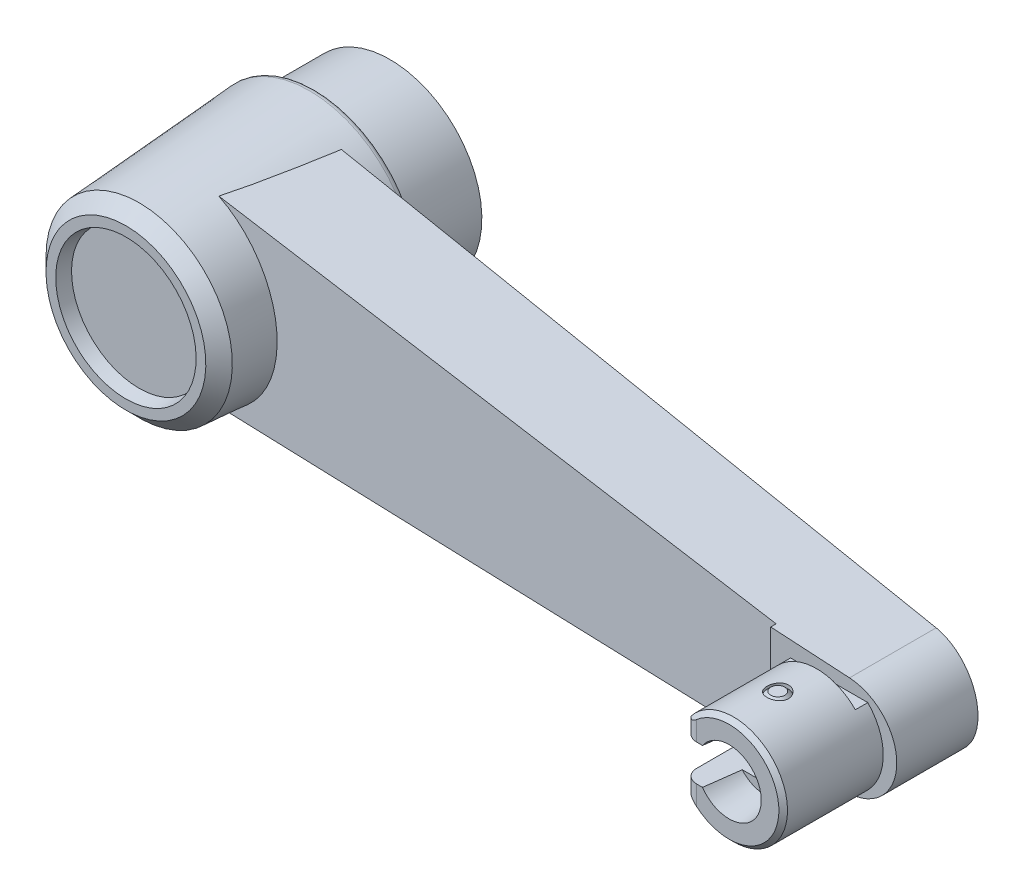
ISO-10303-21;
HEADER;
FILE_DESCRIPTION(('STEP AP214'),'2;1');
FILE_NAME('part.step','',(''),(''),'','','');
FILE_SCHEMA(('AUTOMOTIVE_DESIGN { 1 0 10303 214 1 1 1 1 }'));
ENDSEC;
DATA;
#1=APPLICATION_CONTEXT('core data for automotive mechanical design processes');
#2=APPLICATION_PROTOCOL_DEFINITION('international standard','automotive_design',2000,#1);
#3=PRODUCT_CONTEXT('',#1,'mechanical');
#4=PRODUCT('Part','Part','',(#3));
#5=PRODUCT_RELATED_PRODUCT_CATEGORY('part','',(#4));
#6=PRODUCT_DEFINITION_FORMATION('','',#4);
#7=PRODUCT_DEFINITION_CONTEXT('part definition',#1,'design');
#8=PRODUCT_DEFINITION('design','',#6,#7);
#9=PRODUCT_DEFINITION_SHAPE('','',#8);
#10=(LENGTH_UNIT() NAMED_UNIT(*) SI_UNIT(.MILLI.,.METRE.));
#11=(NAMED_UNIT(*) PLANE_ANGLE_UNIT() SI_UNIT($,.RADIAN.));
#12=(NAMED_UNIT(*) SI_UNIT($,.STERADIAN.) SOLID_ANGLE_UNIT());
#13=UNCERTAINTY_MEASURE_WITH_UNIT(LENGTH_MEASURE(1.E-05),#10,'distance_accuracy_value','');
#14=(GEOMETRIC_REPRESENTATION_CONTEXT(3) GLOBAL_UNCERTAINTY_ASSIGNED_CONTEXT((#13)) GLOBAL_UNIT_ASSIGNED_CONTEXT((#10,
#11,#12)) REPRESENTATION_CONTEXT('',''));
#15=CARTESIAN_POINT('',(0.,0.,0.));
#16=DIRECTION('',(0.,0.,1.));
#17=DIRECTION('',(1.,0.,0.));
#18=AXIS2_PLACEMENT_3D('',#15,#16,#17);
#19=CARTESIAN_POINT('',(130.,0.,49.0000000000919));
#20=DIRECTION('',(0.,0.,-1.));
#21=DIRECTION('',(0.,1.,0.));
#22=AXIS2_PLACEMENT_3D('',#19,#20,#21);
#23=CONICAL_SURFACE('',#22,2.99999999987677,0.785398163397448);
#24=CARTESIAN_POINT('',(130.,0.,48.9999999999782));
#25=DIRECTION('',(0.,0.,-1.));
#26=DIRECTION('',(0.,1.,0.));
#27=AXIS2_PLACEMENT_3D('',#24,#25,#26);
#28=CIRCLE('',#27,2.99999999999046);
#29=CARTESIAN_POINT('',(130.,2.99999999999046,48.9999999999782));
#30=VERTEX_POINT('',#29);
#31=EDGE_CURVE('E9',#30,#30,#28,.F.);
#32=ORIENTED_EDGE('',*,*,#31,.F.);
#33=EDGE_LOOP('',(#32));
#34=FACE_BOUND('',#33,.T.);
#35=CARTESIAN_POINT('',(130.,0.,49.5414999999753));
#36=DIRECTION('',(0.,0.,-1.));
#37=DIRECTION('',(-1.,0.,0.));
#38=AXIS2_PLACEMENT_3D('',#35,#36,#37);
#39=CIRCLE('',#38,2.45849999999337);
#40=CARTESIAN_POINT('',(127.541500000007,0.,49.5414999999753));
#41=VERTEX_POINT('',#40);
#42=EDGE_CURVE('E173',#41,#41,#39,.T.);
#43=ORIENTED_EDGE('',*,*,#42,.F.);
#44=EDGE_LOOP('',(#43));
#45=FACE_BOUND('',#44,.T.);
#46=ADVANCED_FACE('F15',(#34,#45),#23,.F.);
#47=CARTESIAN_POINT('',(130.,0.,51.5));
#48=DIRECTION('',(0.,0.,-1.));
#49=DIRECTION('',(0.,1.,0.));
#50=AXIS2_PLACEMENT_3D('',#47,#48,#49);
#51=CYLINDRICAL_SURFACE('',#50,2.4585);
#52=ORIENTED_EDGE('',*,*,#42,.T.);
#53=EDGE_LOOP('',(#52));
#54=FACE_BOUND('',#53,.T.);
#55=CARTESIAN_POINT('',(130.,0.,53.4585000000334));
#56=DIRECTION('',(0.,0.,1.));
#57=DIRECTION('',(-1.,0.,0.));
#58=AXIS2_PLACEMENT_3D('',#55,#56,#57);
#59=CIRCLE('',#58,2.45849999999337);
#60=CARTESIAN_POINT('',(127.541500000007,0.,53.4585000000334));
#61=VERTEX_POINT('',#60);
#62=EDGE_CURVE('E172',#61,#61,#59,.T.);
#63=ORIENTED_EDGE('',*,*,#62,.T.);
#64=EDGE_LOOP('',(#63));
#65=FACE_BOUND('',#64,.T.);
#66=ADVANCED_FACE('F710',(#54,#65),#51,.F.);
#67=CARTESIAN_POINT('',(130.,20.,58.5));
#68=DIRECTION('',(0.,1.,0.));
#69=DIRECTION('',(-1.,0.,0.));
#70=AXIS2_PLACEMENT_3D('',#67,#68,#69);
#71=CYLINDRICAL_SURFACE('',#70,1.99);
#72=CARTESIAN_POINT('',(130.,9.31,58.5));
#73=DIRECTION('',(0.,1.,0.));
#74=DIRECTION('',(-1.,0.,0.));
#75=AXIS2_PLACEMENT_3D('',#72,#73,#74);
#76=CIRCLE('',#75,1.99);
#77=CARTESIAN_POINT('',(128.01,9.31,58.5));
#78=VERTEX_POINT('',#77);
#79=EDGE_CURVE('E478',#78,#78,#76,.T.);
#80=ORIENTED_EDGE('',*,*,#79,.F.);
#81=EDGE_LOOP('',(#80));
#82=FACE_BOUND('',#81,.T.);
#83=CARTESIAN_POINT('',(128.01,9.79999489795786,58.5));
#84=CARTESIAN_POINT('',(128.010005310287,9.79999763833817,58.3895298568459));
#85=CARTESIAN_POINT('',(128.019238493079,9.80188491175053,58.2789222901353));
#86=CARTESIAN_POINT('',(128.055922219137,9.80922511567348,58.0607469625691));
#87=CARTESIAN_POINT('',(128.083408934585,9.81468512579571,57.9531856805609));
#88=CARTESIAN_POINT('',(128.155716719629,9.82852805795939,57.7444225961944));
#89=CARTESIAN_POINT('',(128.20051272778,9.83690675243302,57.6432118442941));
#90=CARTESIAN_POINT('',(128.306107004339,9.85563737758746,57.4497762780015));
#91=CARTESIAN_POINT('',(128.366900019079,9.86598866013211,57.3575485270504));
#92=CARTESIAN_POINT('',(128.503683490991,9.88766297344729,57.1833552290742));
#93=CARTESIAN_POINT('',(128.579856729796,9.8989966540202,57.1015344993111));
#94=CARTESIAN_POINT('',(128.744847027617,9.92126545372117,56.9517401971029));
#95=CARTESIAN_POINT('',(128.833665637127,9.93220052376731,56.8837683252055));
#96=CARTESIAN_POINT('',(129.022370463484,9.95255291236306,56.7630511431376));
#97=CARTESIAN_POINT('',(129.12234532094,9.96195636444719,56.7104418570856));
#98=CARTESIAN_POINT('',(129.329932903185,9.97806764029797,56.6228215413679));
#99=CARTESIAN_POINT('',(129.437544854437,9.98477573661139,56.5878087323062));
#100=CARTESIAN_POINT('',(129.6558629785,9.99466601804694,56.5368212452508));
#101=CARTESIAN_POINT('',(129.766510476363,9.99789305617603,56.5206041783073));
#102=CARTESIAN_POINT('',(129.988999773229,10.0006125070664,56.5069123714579));
#103=CARTESIAN_POINT('',(130.100841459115,10.0001052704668,56.5094358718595));
#104=CARTESIAN_POINT('',(130.320877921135,9.99544811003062,56.5329695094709));
#105=CARTESIAN_POINT('',(130.429101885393,9.99134966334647,56.5537184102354));
#106=CARTESIAN_POINT('',(130.640501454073,9.98002857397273,56.6126998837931));
#107=CARTESIAN_POINT('',(130.743676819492,9.97280578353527,56.6509332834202));
#108=CARTESIAN_POINT('',(130.942798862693,9.95596237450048,56.7440424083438));
#109=CARTESIAN_POINT('',(131.03869606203,9.94632697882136,56.7990211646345));
#110=CARTESIAN_POINT('',(131.219993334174,9.92572178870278,56.9239798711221));
#111=CARTESIAN_POINT('',(131.305392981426,9.91475194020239,56.9939604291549));
#112=CARTESIAN_POINT('',(131.464814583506,9.89246776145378,57.1483563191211));
#113=CARTESIAN_POINT('',(131.538617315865,9.8811507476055,57.2329977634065));
#114=CARTESIAN_POINT('',(131.671048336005,9.85962042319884,57.4136118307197));
#115=CARTESIAN_POINT('',(131.729669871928,9.84940760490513,57.5095894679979));
#116=CARTESIAN_POINT('',(131.830145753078,9.8312354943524,57.7104911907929));
#117=CARTESIAN_POINT('',(131.871951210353,9.82328279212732,57.8154403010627));
#118=CARTESIAN_POINT('',(131.937188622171,9.81062801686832,58.0309332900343));
#119=CARTESIAN_POINT('',(131.960659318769,9.80591909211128,58.141464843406));
#120=CARTESIAN_POINT('',(131.979744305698,9.80207265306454,58.2940310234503));
#121=CARTESIAN_POINT('',(131.983586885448,9.80129532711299,58.3351213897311));
#122=CARTESIAN_POINT('',(131.988715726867,9.80025593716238,58.4174681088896));
#123=CARTESIAN_POINT('',(131.99000198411,9.79999387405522,58.4587244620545));
#124=CARTESIAN_POINT('',(131.989994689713,9.79999763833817,58.6104701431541));
#125=CARTESIAN_POINT('',(131.980761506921,9.80188491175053,58.7210777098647));
#126=CARTESIAN_POINT('',(131.944077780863,9.80922511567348,58.9392530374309));
#127=CARTESIAN_POINT('',(131.916591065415,9.81468512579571,59.0468143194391));
#128=CARTESIAN_POINT('',(131.844283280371,9.82852805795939,59.2555774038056));
#129=CARTESIAN_POINT('',(131.79948727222,9.83690675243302,59.3567881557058));
#130=CARTESIAN_POINT('',(131.693892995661,9.85563737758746,59.5502237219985));
#131=CARTESIAN_POINT('',(131.633099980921,9.86598866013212,59.6424514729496));
#132=CARTESIAN_POINT('',(131.496316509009,9.88766297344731,59.8166447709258));
#133=CARTESIAN_POINT('',(131.420143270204,9.89899665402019,59.8984655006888));
#134=CARTESIAN_POINT('',(131.255152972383,9.92126545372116,60.0482598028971));
#135=CARTESIAN_POINT('',(131.166334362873,9.93220052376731,60.1162316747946));
#136=CARTESIAN_POINT('',(130.977629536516,9.95255291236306,60.2369488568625));
#137=CARTESIAN_POINT('',(130.87765467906,9.96195636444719,60.2895581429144));
#138=CARTESIAN_POINT('',(130.670067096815,9.97806764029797,60.3771784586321));
#139=CARTESIAN_POINT('',(130.562455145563,9.98477573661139,60.4121912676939));
#140=CARTESIAN_POINT('',(130.3441370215,9.99466601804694,60.4631787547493));
#141=CARTESIAN_POINT('',(130.233489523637,9.99789305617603,60.4793958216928));
#142=CARTESIAN_POINT('',(130.011000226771,10.0006125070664,60.4930876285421));
#143=CARTESIAN_POINT('',(129.899158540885,10.0001052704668,60.4905641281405));
#144=CARTESIAN_POINT('',(129.679122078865,9.99544811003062,60.4670304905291));
#145=CARTESIAN_POINT('',(129.570898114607,9.99134966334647,60.4462815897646));
#146=CARTESIAN_POINT('',(129.359498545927,9.98002857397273,60.3873001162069));
#147=CARTESIAN_POINT('',(129.256323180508,9.97280578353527,60.3490667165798));
#148=CARTESIAN_POINT('',(129.057201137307,9.95596237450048,60.2559575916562));
#149=CARTESIAN_POINT('',(128.96130393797,9.94632697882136,60.2009788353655));
#150=CARTESIAN_POINT('',(128.780006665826,9.92572178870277,60.0760201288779));
#151=CARTESIAN_POINT('',(128.694607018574,9.91475194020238,60.0060395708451));
#152=CARTESIAN_POINT('',(128.535185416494,9.89246776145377,59.8516436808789));
#153=CARTESIAN_POINT('',(128.461382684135,9.88115074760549,59.7670022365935));
#154=CARTESIAN_POINT('',(128.328951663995,9.85962042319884,59.5863881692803));
#155=CARTESIAN_POINT('',(128.270330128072,9.84940760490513,59.4904105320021));
#156=CARTESIAN_POINT('',(128.169854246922,9.8312354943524,59.2895088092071));
#157=CARTESIAN_POINT('',(128.128048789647,9.82328279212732,59.1845596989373));
#158=CARTESIAN_POINT('',(128.062811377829,9.81062801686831,58.9690667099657));
#159=CARTESIAN_POINT('',(128.039340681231,9.80591909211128,58.858535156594));
#160=CARTESIAN_POINT('',(128.020255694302,9.80207265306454,58.7059689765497));
#161=CARTESIAN_POINT('',(128.016413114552,9.80129532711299,58.6648786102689));
#162=CARTESIAN_POINT('',(128.011284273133,9.80025593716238,58.5825318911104));
#163=CARTESIAN_POINT('',(128.00999801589,9.79999387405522,58.5412755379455));
#164=CARTESIAN_POINT('',(128.01,9.79999489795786,58.5));
#165=B_SPLINE_CURVE_WITH_KNOTS('',3,(#83,#84,#85,#86,#87,#88,#89,#90,#91,#92,#93,#94,#95,#96,
#97,#98,#99,#100,#101,#102,#103,#104,#105,#106,#107,#108,#109,#110,#111,#112,#113,#114,#115,
#116,#117,#118,#119,#120,#121,#122,#123,#124,#125,#126,#127,#128,#129,#130,#131,#132,#133,#134,
#135,#136,#137,#138,#139,#140,#141,#142,#143,#144,#145,#146,#147,#148,#149,#150,#151,#152,#153,
#154,#155,#156,#157,#158,#159,#160,#161,#162,#163,#164),.UNSPECIFIED.,.T.,.F.,(4,2,2,2,2,2,2,2,
2,2,2,2,2,2,2,2,2,2,2,2,2,2,2,2,2,2,2,2,2,2,2,2,2,2,2,2,2,2,2,2,4),(0.,0.331252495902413,
0.66316338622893,0.994595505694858,1.32591891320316,1.6614399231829,1.99700210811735,
2.3354511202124,2.67386590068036,3.0078661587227,3.3418350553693,3.67109367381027,
4.00036786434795,4.33171040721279,4.66306637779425,5.00008140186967,5.33724605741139,
5.67538395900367,6.01280541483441,6.13657280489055,6.26034040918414,6.59159290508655,
6.92350379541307,7.25493591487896,7.5862593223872,7.92178033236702,8.25734251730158,
8.59579152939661,8.93420630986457,9.26820656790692,9.6021754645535,9.9314340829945,
10.2607082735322,10.592050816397,10.9234067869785,11.260421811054,11.5975864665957,
11.9357243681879,12.2731458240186,12.3969132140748,12.5206808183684),.UNSPECIFIED.);
#166=CARTESIAN_POINT('',(128.01,9.79999489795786,58.5));
#167=VERTEX_POINT('',#166);
#168=EDGE_CURVE('E186',#167,#167,#165,.T.);
#169=ORIENTED_EDGE('',*,*,#168,.F.);
#170=EDGE_LOOP('',(#169));
#171=FACE_BOUND('',#170,.T.);
#172=ADVANCED_FACE('F203',(#82,#171),#71,.F.);
#173=CARTESIAN_POINT('',(124.,20.,65.));
#174=DIRECTION('',(0.,1.,0.));
#175=DIRECTION('',(-1.,0.,0.));
#176=AXIS2_PLACEMENT_3D('',#173,#174,#175);
#177=CYLINDRICAL_SURFACE('',#176,2.5);
#178=CARTESIAN_POINT('',(121.5,5.26782687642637,65.));
#179=CARTESIAN_POINT('',(121.499993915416,5.26781361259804,65.0407404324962));
#180=CARTESIAN_POINT('',(121.500996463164,5.26943497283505,65.081457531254));
#181=CARTESIAN_POINT('',(121.504958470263,5.27582141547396,65.1624971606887));
#182=CARTESIAN_POINT('',(121.507915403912,5.28058244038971,65.2028201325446));
#183=CARTESIAN_POINT('',(121.519493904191,5.29917282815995,65.3214260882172));
#184=CARTESIAN_POINT('',(121.530828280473,5.31731957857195,65.3987996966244));
#185=CARTESIAN_POINT('',(121.563982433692,5.36980465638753,65.5705293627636));
#186=CARTESIAN_POINT('',(121.587861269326,5.40727104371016,65.6634983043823));
#187=CARTESIAN_POINT('',(121.644266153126,5.49403389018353,65.8422883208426));
#188=CARTESIAN_POINT('',(121.676903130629,5.54348125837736,65.9279977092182));
#189=CARTESIAN_POINT('',(121.743330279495,5.6418410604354,66.0784748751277));
#190=CARTESIAN_POINT('',(121.776150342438,5.68963890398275,66.1444257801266));
#191=CARTESIAN_POINT('',(121.845973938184,5.78926291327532,66.270983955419));
#192=CARTESIAN_POINT('',(121.882983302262,5.84109466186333,66.3315835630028));
#193=CARTESIAN_POINT('',(121.95949895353,5.94595859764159,66.4460143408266));
#194=CARTESIAN_POINT('',(121.998898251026,5.99890924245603,66.4999932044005));
#195=CARTESIAN_POINT('',(122.080718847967,6.10651962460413,66.6033273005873));
#196=CARTESIAN_POINT('',(122.123129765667,6.1611731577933,66.652697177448));
#197=CARTESIAN_POINT('',(122.166969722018,6.21640061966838,66.7));
#198=B_SPLINE_CURVE_WITH_KNOTS('',3,(#178,#179,#180,#181,#182,#183,#184,#185,#186,#187,#188,
#189,#190,#191,#192,#193,#194,#195,#196,#197),.UNSPECIFIED.,.F.,.F.,(4,2,2,2,2,2,2,2,2,4),(0.,
0.122134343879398,0.244111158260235,0.483768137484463,0.791215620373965,1.10275773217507,
1.36581050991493,1.62923405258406,1.88482351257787,2.13957107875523),.UNSPECIFIED.);
#199=CARTESIAN_POINT('',(121.5,5.26782687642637,65.));
#200=VERTEX_POINT('',#199);
#201=CARTESIAN_POINT('',(122.166969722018,6.21640061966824,66.7));
#202=VERTEX_POINT('',#201);
#203=EDGE_CURVE('E196',#200,#202,#198,.T.);
#204=ORIENTED_EDGE('',*,*,#203,.F.);
#205=DIRECTION('',(0.,1.,0.));
#206=VECTOR('',#205,1.);
#207=CARTESIAN_POINT('',(121.5,20.,65.));
#208=LINE('',#207,#206);
#209=CARTESIAN_POINT('',(121.5,3.35,65.));
#210=VERTEX_POINT('',#209);
#211=EDGE_CURVE('E458',#200,#210,#208,.F.);
#212=ORIENTED_EDGE('',*,*,#211,.T.);
#213=CARTESIAN_POINT('',(124.,3.35,65.));
#214=DIRECTION('',(0.,1.,0.));
#215=DIRECTION('',(-1.,0.,0.));
#216=AXIS2_PLACEMENT_3D('',#213,#214,#215);
#217=CIRCLE('',#216,2.5);
#218=CARTESIAN_POINT('',(124.,3.35,67.5));
#219=VERTEX_POINT('',#218);
#220=EDGE_CURVE('E464',#210,#219,#217,.T.);
#221=ORIENTED_EDGE('',*,*,#220,.T.);
#222=DIRECTION('',(0.,1.,0.));
#223=VECTOR('',#222,1.);
#224=CARTESIAN_POINT('',(124.,20.,67.5));
#225=LINE('',#224,#223);
#226=CARTESIAN_POINT('',(124.,6.97423830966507,67.5));
#227=VERTEX_POINT('',#226);
#228=EDGE_CURVE('E462',#219,#227,#225,.T.);
#229=ORIENTED_EDGE('',*,*,#228,.T.);
#230=CARTESIAN_POINT('',(122.166969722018,6.2164006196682,66.7));
#231=CARTESIAN_POINT('',(122.188591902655,6.20613655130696,66.7233161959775));
#232=CARTESIAN_POINT('',(122.210901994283,6.1969866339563,66.7464764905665));
#233=CARTESIAN_POINT('',(122.256831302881,6.18105975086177,66.7923216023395));
#234=CARTESIAN_POINT('',(122.280450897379,6.17428347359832,66.8150062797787));
#235=CARTESIAN_POINT('',(122.352828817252,6.15781430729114,66.881780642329));
#236=CARTESIAN_POINT('',(122.403398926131,6.1518394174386,66.9249085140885));
#237=CARTESIAN_POINT('',(122.508027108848,6.15009251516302,67.0071025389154));
#238=CARTESIAN_POINT('',(122.562092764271,6.15434345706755,67.0461593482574));
#239=CARTESIAN_POINT('',(122.672040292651,6.17211895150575,67.1191713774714));
#240=CARTESIAN_POINT('',(122.727922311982,6.18564425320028,67.1531261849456));
#241=CARTESIAN_POINT('',(122.863056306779,6.22744967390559,67.2283456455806));
#242=CARTESIAN_POINT('',(122.942588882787,6.25949014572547,67.2669845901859));
#243=CARTESIAN_POINT('',(123.101207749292,6.3345627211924,67.3344575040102));
#244=CARTESIAN_POINT('',(123.180285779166,6.37767824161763,67.3632130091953));
#245=CARTESIAN_POINT('',(123.32374330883,6.46363541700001,67.4077675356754));
#246=CARTESIAN_POINT('',(123.388398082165,6.50535201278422,67.4249206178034));
#247=CARTESIAN_POINT('',(123.516397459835,6.59268899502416,67.4536577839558));
#248=CARTESIAN_POINT('',(123.579740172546,6.63831458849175,67.4652342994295));
#249=CARTESIAN_POINT('',(123.703445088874,6.73127677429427,67.483116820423));
#250=CARTESIAN_POINT('',(123.763842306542,6.7785445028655,67.4895444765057));
#251=CARTESIAN_POINT('',(123.883055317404,6.87504174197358,67.4979718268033));
#252=CARTESIAN_POINT('',(123.94187552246,6.92426454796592,67.4999855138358));
#253=CARTESIAN_POINT('',(124.,6.97423830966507,67.5));
#254=B_SPLINE_CURVE_WITH_KNOTS('',3,(#230,#231,#232,#233,#234,#235,#236,#237,#238,#239,#240,
#241,#242,#243,#244,#245,#246,#247,#248,#249,#250,#251,#252,#253),.UNSPECIFIED.,.F.,.F.,(4,2,2,
2,2,2,2,2,2,2,2,4),(0.,0.10019970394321,0.200428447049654,0.399539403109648,0.599097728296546,
0.798672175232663,1.07923967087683,1.36198573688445,1.59815115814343,1.83463620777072,
2.06535392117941,2.29533916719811),.UNSPECIFIED.);
#255=EDGE_CURVE('E461',#202,#227,#254,.T.);
#256=ORIENTED_EDGE('',*,*,#255,.F.);
#257=EDGE_LOOP('',(#204,#212,#221,#229,#256));
#258=FACE_BOUND('',#257,.T.);
#259=ADVANCED_FACE('F213',(#258),#177,.T.);
#260=CARTESIAN_POINT('',(130.,0.,57.85));
#261=DIRECTION('',(0.,0.,-1.));
#262=DIRECTION('',(0.,1.,0.));
#263=AXIS2_PLACEMENT_3D('',#260,#261,#262);
#264=CYLINDRICAL_SURFACE('',#263,10.);
#265=DIRECTION('',(0.,0.,-1.));
#266=VECTOR('',#265,1.);
#267=CARTESIAN_POINT('',(137.141428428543,-6.99999999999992,57.85));
#268=LINE('',#267,#266);
#269=CARTESIAN_POINT('',(137.141428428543,-7.,51.3));
#270=VERTEX_POINT('',#269);
#271=CARTESIAN_POINT('',(137.141428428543,-7.,49.));
#272=VERTEX_POINT('',#271);
#273=EDGE_CURVE('E474',#270,#272,#268,.T.);
#274=ORIENTED_EDGE('',*,*,#273,.T.);
#275=CARTESIAN_POINT('',(130.,0.,49.));
#276=DIRECTION('',(0.,0.,-1.));
#277=DIRECTION('',(0.,1.,0.));
#278=AXIS2_PLACEMENT_3D('',#275,#276,#277);
#279=CIRCLE('',#278,10.);
#280=CARTESIAN_POINT('',(137.141428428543,7.,49.));
#281=VERTEX_POINT('',#280);
#282=EDGE_CURVE('E445',#281,#272,#279,.T.);
#283=ORIENTED_EDGE('',*,*,#282,.F.);
#284=DIRECTION('',(0.,0.,-1.));
#285=VECTOR('',#284,1.);
#286=CARTESIAN_POINT('',(137.141428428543,6.99999999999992,57.85));
#287=LINE('',#286,#285);
#288=CARTESIAN_POINT('',(137.141428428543,7.,51.3));
#289=VERTEX_POINT('',#288);
#290=EDGE_CURVE('E475',#281,#289,#287,.F.);
#291=ORIENTED_EDGE('',*,*,#290,.T.);
#292=CARTESIAN_POINT('',(130.,0.,51.3));
#293=DIRECTION('',(0.,0.,-1.));
#294=DIRECTION('',(0.,1.,0.));
#295=AXIS2_PLACEMENT_3D('',#292,#293,#294);
#296=CIRCLE('',#295,10.);
#297=CARTESIAN_POINT('',(122.858571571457,7.,51.3));
#298=VERTEX_POINT('',#297);
#299=EDGE_CURVE('E470',#289,#298,#296,.F.);
#300=ORIENTED_EDGE('',*,*,#299,.T.);
#301=DIRECTION('',(0.,0.,-1.));
#302=VECTOR('',#301,1.);
#303=CARTESIAN_POINT('',(122.858571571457,7.,57.85));
#304=LINE('',#303,#302);
#305=CARTESIAN_POINT('',(122.858571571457,7.,49.));
#306=VERTEX_POINT('',#305);
#307=EDGE_CURVE('E457',#298,#306,#304,.T.);
#308=ORIENTED_EDGE('',*,*,#307,.T.);
#309=CARTESIAN_POINT('',(121.5,5.26782687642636,49.));
#310=VERTEX_POINT('',#309);
#311=EDGE_CURVE('E440',#310,#306,#279,.T.);
#312=ORIENTED_EDGE('',*,*,#311,.F.);
#313=DIRECTION('',(0.,0.,-1.));
#314=VECTOR('',#313,1.);
#315=CARTESIAN_POINT('',(121.5,5.26782687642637,57.85));
#316=LINE('',#315,#314);
#317=EDGE_CURVE('E454',#310,#200,#316,.F.);
#318=ORIENTED_EDGE('',*,*,#317,.T.);
#319=ORIENTED_EDGE('',*,*,#203,.T.);
#320=CARTESIAN_POINT('',(130.,0.,66.7));
#321=DIRECTION('',(0.,0.,-1.));
#322=DIRECTION('',(0.,1.,0.));
#323=AXIS2_PLACEMENT_3D('',#320,#321,#322);
#324=CIRCLE('',#323,10.);
#325=CARTESIAN_POINT('',(122.166969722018,-6.21640061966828,66.7));
#326=VERTEX_POINT('',#325);
#327=EDGE_CURVE('E195',#202,#326,#324,.T.);
#328=ORIENTED_EDGE('',*,*,#327,.T.);
#329=CARTESIAN_POINT('',(122.166969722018,-6.21640061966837,66.7));
#330=CARTESIAN_POINT('',(122.124021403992,-6.16229561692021,66.6536615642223));
#331=CARTESIAN_POINT('',(122.082445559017,-6.10874371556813,66.6053373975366));
#332=CARTESIAN_POINT('',(122.002176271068,-6.00326427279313,66.5042950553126));
#333=CARTESIAN_POINT('',(121.963492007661,-5.9513421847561,66.4515639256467));
#334=CARTESIAN_POINT('',(121.888440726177,-5.84865470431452,66.3401274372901));
#335=CARTESIAN_POINT('',(121.852160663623,-5.79795498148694,66.2813019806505));
#336=CARTESIAN_POINT('',(121.783551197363,-5.70030896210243,66.1585728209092));
#337=CARTESIAN_POINT('',(121.751216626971,-5.65335778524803,66.0946759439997));
#338=CARTESIAN_POINT('',(121.687913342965,-5.55992068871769,65.9543542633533));
#339=CARTESIAN_POINT('',(121.657444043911,-5.51400063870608,65.8773184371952));
#340=CARTESIAN_POINT('',(121.603565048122,-5.43160046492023,65.7170361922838));
#341=CARTESIAN_POINT('',(121.580080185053,-5.39502047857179,65.6338688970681));
#342=CARTESIAN_POINT('',(121.5510990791,-5.34942970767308,65.5047938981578));
#343=CARTESIAN_POINT('',(121.542496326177,-5.33580649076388,65.4611857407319));
#344=CARTESIAN_POINT('',(121.527525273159,-5.31200226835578,65.3726685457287));
#345=CARTESIAN_POINT('',(121.521156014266,-5.30181978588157,65.3277600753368));
#346=CARTESIAN_POINT('',(121.510733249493,-5.2851164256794,65.2360451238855));
#347=CARTESIAN_POINT('',(121.506729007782,-5.27867348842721,65.1892186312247));
#348=CARTESIAN_POINT('',(121.50135193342,-5.27000825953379,65.0949366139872));
#349=CARTESIAN_POINT('',(121.49998435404,-5.26779439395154,65.0474800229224));
#350=CARTESIAN_POINT('',(121.5,-5.26782687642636,65.));
#351=B_SPLINE_CURVE_WITH_KNOTS('',3,(#329,#330,#331,#332,#333,#334,#335,#336,#337,#338,#339,
#340,#341,#342,#343,#344,#345,#346,#347,#348,#349,#350),.UNSPECIFIED.,.F.,.F.,(4,2,2,2,2,2,2,2,
2,2,4),(0.,0.249563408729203,0.499888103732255,0.756753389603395,1.01327861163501,
1.29672359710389,1.57699751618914,1.71629941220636,1.85554143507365,1.9975900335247,
2.13992135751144),.UNSPECIFIED.);
#352=CARTESIAN_POINT('',(121.5,-5.26782687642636,65.));
#353=VERTEX_POINT('',#352);
#354=EDGE_CURVE('E230',#326,#353,#351,.T.);
#355=ORIENTED_EDGE('',*,*,#354,.T.);
#356=DIRECTION('',(0.,0.,1.));
#357=VECTOR('',#356,1.);
#358=CARTESIAN_POINT('',(121.5,-5.26782687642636,65.));
#359=LINE('',#358,#357);
#360=CARTESIAN_POINT('',(121.5,-5.26782687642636,49.));
#361=VERTEX_POINT('',#360);
#362=EDGE_CURVE('E493',#353,#361,#359,.F.);
#363=ORIENTED_EDGE('',*,*,#362,.T.);
#364=CARTESIAN_POINT('',(130.,0.,49.));
#365=DIRECTION('',(0.,0.,-1.));
#366=DIRECTION('',(0.,1.,0.));
#367=AXIS2_PLACEMENT_3D('',#364,#365,#366);
#368=CIRCLE('',#367,10.);
#369=CARTESIAN_POINT('',(122.858571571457,-7.,49.));
#370=VERTEX_POINT('',#369);
#371=EDGE_CURVE('E449',#370,#361,#368,.T.);
#372=ORIENTED_EDGE('',*,*,#371,.F.);
#373=DIRECTION('',(0.,0.,-1.));
#374=VECTOR('',#373,1.);
#375=CARTESIAN_POINT('',(122.858571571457,-6.99999999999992,57.85));
#376=LINE('',#375,#374);
#377=CARTESIAN_POINT('',(122.858571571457,-7.,51.3));
#378=VERTEX_POINT('',#377);
#379=EDGE_CURVE('E238',#370,#378,#376,.F.);
#380=ORIENTED_EDGE('',*,*,#379,.T.);
#381=CARTESIAN_POINT('',(130.,0.,51.3));
#382=DIRECTION('',(0.,0.,-1.));
#383=DIRECTION('',(0.,1.,0.));
#384=AXIS2_PLACEMENT_3D('',#381,#382,#383);
#385=CIRCLE('',#384,10.);
#386=EDGE_CURVE('E239',#378,#270,#385,.F.);
#387=ORIENTED_EDGE('',*,*,#386,.T.);
#388=EDGE_LOOP('',(#274,#283,#291,#300,#308,#312,#318,#319,#328,#355,#363,#372,#380,#387));
#389=FACE_BOUND('',#388,.T.);
#390=CARTESIAN_POINT('',(128.01,-9.79999489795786,58.5));
#391=CARTESIAN_POINT('',(128.010005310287,-9.79999763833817,58.6104701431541));
#392=CARTESIAN_POINT('',(128.019238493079,-9.80188491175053,58.7210777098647));
#393=CARTESIAN_POINT('',(128.055922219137,-9.80922511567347,58.9392530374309));
#394=CARTESIAN_POINT('',(128.083408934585,-9.8146851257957,59.0468143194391));
#395=CARTESIAN_POINT('',(128.155716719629,-9.82852805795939,59.2555774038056));
#396=CARTESIAN_POINT('',(128.20051272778,-9.83690675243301,59.3567881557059));
#397=CARTESIAN_POINT('',(128.306107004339,-9.85563737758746,59.5502237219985));
#398=CARTESIAN_POINT('',(128.366900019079,-9.86598866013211,59.6424514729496));
#399=CARTESIAN_POINT('',(128.503683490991,-9.88766297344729,59.8166447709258));
#400=CARTESIAN_POINT('',(128.579856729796,-9.89899665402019,59.8984655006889));
#401=CARTESIAN_POINT('',(128.744847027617,-9.92126545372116,60.0482598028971));
#402=CARTESIAN_POINT('',(128.833665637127,-9.93220052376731,60.1162316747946));
#403=CARTESIAN_POINT('',(129.022370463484,-9.95255291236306,60.2369488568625));
#404=CARTESIAN_POINT('',(129.12234532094,-9.96195636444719,60.2895581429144));
#405=CARTESIAN_POINT('',(129.329932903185,-9.97806764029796,60.3771784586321));
#406=CARTESIAN_POINT('',(129.437544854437,-9.98477573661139,60.4121912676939));
#407=CARTESIAN_POINT('',(129.6558629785,-9.99466601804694,60.4631787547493));
#408=CARTESIAN_POINT('',(129.766510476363,-9.99789305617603,60.4793958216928));
#409=CARTESIAN_POINT('',(129.988999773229,-10.0006125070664,60.4930876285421));
#410=CARTESIAN_POINT('',(130.100841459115,-10.0001052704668,60.4905641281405));
#411=CARTESIAN_POINT('',(130.320877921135,-9.99544811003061,60.4670304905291));
#412=CARTESIAN_POINT('',(130.429101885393,-9.99134966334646,60.4462815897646));
#413=CARTESIAN_POINT('',(130.640501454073,-9.98002857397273,60.3873001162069));
#414=CARTESIAN_POINT('',(130.743676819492,-9.97280578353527,60.3490667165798));
#415=CARTESIAN_POINT('',(130.942798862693,-9.95596237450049,60.2559575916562));
#416=CARTESIAN_POINT('',(131.03869606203,-9.94632697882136,60.2009788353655));
#417=CARTESIAN_POINT('',(131.219993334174,-9.92572178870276,60.0760201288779));
#418=CARTESIAN_POINT('',(131.305392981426,-9.91475194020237,60.0060395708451));
#419=CARTESIAN_POINT('',(131.464814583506,-9.89246776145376,59.8516436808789));
#420=CARTESIAN_POINT('',(131.538617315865,-9.88115074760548,59.7670022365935));
#421=CARTESIAN_POINT('',(131.671048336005,-9.85962042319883,59.5863881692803));
#422=CARTESIAN_POINT('',(131.729669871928,-9.84940760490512,59.4904105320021));
#423=CARTESIAN_POINT('',(131.830145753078,-9.83123549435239,59.2895088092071));
#424=CARTESIAN_POINT('',(131.871951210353,-9.82328279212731,59.1845596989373));
#425=CARTESIAN_POINT('',(131.937188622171,-9.81062801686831,58.9690667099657));
#426=CARTESIAN_POINT('',(131.960659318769,-9.80591909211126,58.858535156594));
#427=CARTESIAN_POINT('',(131.979744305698,-9.80207265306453,58.7059689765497));
#428=CARTESIAN_POINT('',(131.983586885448,-9.80129532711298,58.6648786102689));
#429=CARTESIAN_POINT('',(131.988715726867,-9.80025593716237,58.5825318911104));
#430=CARTESIAN_POINT('',(131.99000198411,-9.79999387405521,58.5412755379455));
#431=CARTESIAN_POINT('',(131.989994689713,-9.79999763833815,58.389529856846));
#432=CARTESIAN_POINT('',(131.980761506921,-9.80188491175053,58.2789222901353));
#433=CARTESIAN_POINT('',(131.944077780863,-9.80922511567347,58.0607469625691));
#434=CARTESIAN_POINT('',(131.916591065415,-9.8146851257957,57.9531856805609));
#435=CARTESIAN_POINT('',(131.844283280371,-9.82852805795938,57.7444225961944));
#436=CARTESIAN_POINT('',(131.79948727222,-9.83690675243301,57.6432118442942));
#437=CARTESIAN_POINT('',(131.693892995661,-9.85563737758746,57.4497762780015));
#438=CARTESIAN_POINT('',(131.633099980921,-9.86598866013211,57.3575485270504));
#439=CARTESIAN_POINT('',(131.496316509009,-9.88766297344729,57.1833552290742));
#440=CARTESIAN_POINT('',(131.420143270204,-9.89899665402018,57.1015344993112));
#441=CARTESIAN_POINT('',(131.255152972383,-9.92126545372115,56.951740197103));
#442=CARTESIAN_POINT('',(131.166334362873,-9.9322005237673,56.8837683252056));
#443=CARTESIAN_POINT('',(130.977629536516,-9.95255291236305,56.7630511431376));
#444=CARTESIAN_POINT('',(130.87765467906,-9.96195636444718,56.7104418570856));
#445=CARTESIAN_POINT('',(130.670067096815,-9.97806764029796,56.6228215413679));
#446=CARTESIAN_POINT('',(130.562455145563,-9.98477573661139,56.5878087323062));
#447=CARTESIAN_POINT('',(130.3441370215,-9.99466601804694,56.5368212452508));
#448=CARTESIAN_POINT('',(130.233489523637,-9.99789305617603,56.5206041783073));
#449=CARTESIAN_POINT('',(130.011000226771,-10.0006125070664,56.5069123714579));
#450=CARTESIAN_POINT('',(129.899158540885,-10.0001052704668,56.5094358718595));
#451=CARTESIAN_POINT('',(129.679122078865,-9.99544811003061,56.5329695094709));
#452=CARTESIAN_POINT('',(129.570898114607,-9.99134966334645,56.5537184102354));
#453=CARTESIAN_POINT('',(129.359498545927,-9.98002857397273,56.6126998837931));
#454=CARTESIAN_POINT('',(129.256323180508,-9.97280578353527,56.6509332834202));
#455=CARTESIAN_POINT('',(129.057201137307,-9.95596237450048,56.7440424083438));
#456=CARTESIAN_POINT('',(128.96130393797,-9.94632697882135,56.7990211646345));
#457=CARTESIAN_POINT('',(128.780006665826,-9.92572178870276,56.9239798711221));
#458=CARTESIAN_POINT('',(128.694607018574,-9.91475194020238,56.9939604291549));
#459=CARTESIAN_POINT('',(128.535185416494,-9.89246776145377,57.1483563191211));
#460=CARTESIAN_POINT('',(128.461382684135,-9.88115074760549,57.2329977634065));
#461=CARTESIAN_POINT('',(128.328951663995,-9.85962042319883,57.4136118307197));
#462=CARTESIAN_POINT('',(128.270330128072,-9.84940760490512,57.5095894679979));
#463=CARTESIAN_POINT('',(128.169854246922,-9.83123549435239,57.7104911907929));
#464=CARTESIAN_POINT('',(128.128048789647,-9.82328279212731,57.8154403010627));
#465=CARTESIAN_POINT('',(128.062811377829,-9.81062801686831,58.0309332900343));
#466=CARTESIAN_POINT('',(128.039340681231,-9.80591909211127,58.141464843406));
#467=CARTESIAN_POINT('',(128.020255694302,-9.80207265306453,58.2940310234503));
#468=CARTESIAN_POINT('',(128.016413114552,-9.80129532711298,58.3351213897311));
#469=CARTESIAN_POINT('',(128.011284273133,-9.80025593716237,58.4174681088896));
#470=CARTESIAN_POINT('',(128.00999801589,-9.79999387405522,58.4587244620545));
#471=CARTESIAN_POINT('',(128.01,-9.79999489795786,58.5));
#472=B_SPLINE_CURVE_WITH_KNOTS('',3,(#390,#391,#392,#393,#394,#395,#396,#397,#398,#399,#400,
#401,#402,#403,#404,#405,#406,#407,#408,#409,#410,#411,#412,#413,#414,#415,#416,#417,#418,#419,
#420,#421,#422,#423,#424,#425,#426,#427,#428,#429,#430,#431,#432,#433,#434,#435,#436,#437,#438,
#439,#440,#441,#442,#443,#444,#445,#446,#447,#448,#449,#450,#451,#452,#453,#454,#455,#456,#457,
#458,#459,#460,#461,#462,#463,#464,#465,#466,#467,#468,#469,#470,#471),.UNSPECIFIED.,.T.,.F.,(4,
2,2,2,2,2,2,2,2,2,2,2,2,2,2,2,2,2,2,2,2,2,2,2,2,2,2,2,2,2,2,2,2,2,2,2,2,2,2,2,4),(0.,
0.33125249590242,0.663163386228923,0.99459550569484,1.32591891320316,1.66143992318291,
1.99700210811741,2.33545112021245,2.6738659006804,3.00786615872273,3.34183505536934,
3.67109367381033,4.00036786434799,4.33171040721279,4.66306637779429,5.00008140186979,
5.33724605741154,5.67538395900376,6.01280541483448,6.13657280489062,6.2603404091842,
6.59159290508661,6.92350379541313,7.25493591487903,7.58625932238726,7.92178033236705,
8.25734251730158,8.59579152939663,8.93420630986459,9.26820656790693,9.60217546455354,
9.93143408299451,10.2607082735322,10.592050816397,10.9234067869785,11.260421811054,
11.5975864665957,11.935724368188,12.2731458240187,12.3969132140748,12.5206808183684),.UNSPECIFIED.);
#473=CARTESIAN_POINT('',(128.01,-9.79999489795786,58.5));
#474=VERTEX_POINT('',#473);
#475=EDGE_CURVE('E222',#474,#474,#472,.T.);
#476=ORIENTED_EDGE('',*,*,#475,.T.);
#477=EDGE_LOOP('',(#476));
#478=FACE_BOUND('',#477,.T.);
#479=ORIENTED_EDGE('',*,*,#168,.T.);
#480=EDGE_LOOP('',(#479));
#481=FACE_BOUND('',#480,.T.);
#482=ADVANCED_FACE('F207',(#389,#478,#481),#264,.T.);
#483=CARTESIAN_POINT('',(110.,7.,49.));
#484=DIRECTION('',(0.,-1.,0.));
#485=DIRECTION('',(1.,0.,0.));
#486=AXIS2_PLACEMENT_3D('',#483,#484,#485);
#487=PLANE('',#486);
#488=DIRECTION('',(1.,0.,0.));
#489=VECTOR('',#488,1.);
#490=CARTESIAN_POINT('',(125.,7.,49.));
#491=LINE('',#490,#489);
#492=EDGE_CURVE('E448',#306,#281,#491,.T.);
#493=ORIENTED_EDGE('',*,*,#492,.F.);
#494=ORIENTED_EDGE('',*,*,#307,.F.);
#495=DIRECTION('',(1.,0.,0.));
#496=VECTOR('',#495,1.);
#497=CARTESIAN_POINT('',(110.,7.,51.3));
#498=LINE('',#497,#496);
#499=EDGE_CURVE('E471',#289,#298,#498,.F.);
#500=ORIENTED_EDGE('',*,*,#499,.F.);
#501=ORIENTED_EDGE('',*,*,#290,.F.);
#502=EDGE_LOOP('',(#493,#494,#500,#501));
#503=FACE_BOUND('',#502,.T.);
#504=ADVANCED_FACE('F212',(#503),#487,.F.);
#505=CARTESIAN_POINT('',(110.,7.,51.3));
#506=DIRECTION('',(0.,0.,1.));
#507=DIRECTION('',(0.,-1.,0.));
#508=AXIS2_PLACEMENT_3D('',#505,#506,#507);
#509=PLANE('',#508);
#510=ORIENTED_EDGE('',*,*,#499,.T.);
#511=ORIENTED_EDGE('',*,*,#299,.F.);
#512=EDGE_LOOP('',(#510,#511));
#513=FACE_BOUND('',#512,.T.);
#514=ADVANCED_FACE('F215',(#513),#509,.F.);
#515=CARTESIAN_POINT('',(121.5,20.,65.));
#516=DIRECTION('',(1.,0.,0.));
#517=DIRECTION('',(0.,1.,0.));
#518=AXIS2_PLACEMENT_3D('',#515,#516,#517);
#519=PLANE('',#518);
#520=DIRECTION('',(0.,1.,0.));
#521=VECTOR('',#520,1.);
#522=CARTESIAN_POINT('',(121.5,20.,54.));
#523=LINE('',#522,#521);
#524=CARTESIAN_POINT('',(121.5,3.35,54.));
#525=VERTEX_POINT('',#524);
#526=CARTESIAN_POINT('',(121.5,-3.35,54.));
#527=VERTEX_POINT('',#526);
#528=EDGE_CURVE('E492',#525,#527,#523,.F.);
#529=ORIENTED_EDGE('',*,*,#528,.F.);
#530=DIRECTION('',(0.,0.,1.));
#531=VECTOR('',#530,1.);
#532=CARTESIAN_POINT('',(121.5,3.35,65.));
#533=LINE('',#532,#531);
#534=EDGE_CURVE('E490',#210,#525,#533,.F.);
#535=ORIENTED_EDGE('',*,*,#534,.F.);
#536=ORIENTED_EDGE('',*,*,#211,.F.);
#537=ORIENTED_EDGE('',*,*,#317,.F.);
#538=DIRECTION('',(0.,-1.,0.));
#539=VECTOR('',#538,1.);
#540=CARTESIAN_POINT('',(121.5,-35.,49.));
#541=LINE('',#540,#539);
#542=EDGE_CURVE('E443',#310,#361,#541,.T.);
#543=ORIENTED_EDGE('',*,*,#542,.T.);
#544=ORIENTED_EDGE('',*,*,#362,.F.);
#545=DIRECTION('',(0.,1.,0.));
#546=VECTOR('',#545,1.);
#547=CARTESIAN_POINT('',(121.5,20.,65.));
#548=LINE('',#547,#546);
#549=CARTESIAN_POINT('',(121.5,-3.35,65.));
#550=VERTEX_POINT('',#549);
#551=EDGE_CURVE('E473',#550,#353,#548,.F.);
#552=ORIENTED_EDGE('',*,*,#551,.F.);
#553=DIRECTION('',(0.,0.,1.));
#554=VECTOR('',#553,1.);
#555=CARTESIAN_POINT('',(121.5,-3.35,65.));
#556=LINE('',#555,#554);
#557=EDGE_CURVE('E498',#527,#550,#556,.T.);
#558=ORIENTED_EDGE('',*,*,#557,.F.);
#559=EDGE_LOOP('',(#529,#535,#536,#537,#543,#544,#552,#558));
#560=FACE_BOUND('',#559,.T.);
#561=ADVANCED_FACE('F1048',(#560),#519,.F.);
#562=CARTESIAN_POINT('',(130.,0.,54.));
#563=DIRECTION('',(0.,0.,1.));
#564=DIRECTION('',(0.,-1.,0.));
#565=AXIS2_PLACEMENT_3D('',#562,#563,#564);
#566=PLANE('',#565);
#567=CARTESIAN_POINT('',(133.5,2.35,54.));
#568=DIRECTION('',(0.,0.,-1.));
#569=DIRECTION('',(0.,1.,0.));
#570=AXIS2_PLACEMENT_3D('',#567,#568,#569);
#571=CIRCLE('',#570,1.);
#572=CARTESIAN_POINT('',(134.5,2.35,54.));
#573=VERTEX_POINT('',#572);
#574=CARTESIAN_POINT('',(133.5,3.35,54.));
#575=VERTEX_POINT('',#574);
#576=EDGE_CURVE('E512',#573,#575,#571,.F.);
#577=ORIENTED_EDGE('',*,*,#576,.T.);
#578=DIRECTION('',(-1.,0.,0.));
#579=VECTOR('',#578,1.);
#580=CARTESIAN_POINT('',(114.5,3.35,54.));
#581=LINE('',#580,#579);
#582=EDGE_CURVE('E156',#575,#525,#581,.T.);
#583=ORIENTED_EDGE('',*,*,#582,.T.);
#584=ORIENTED_EDGE('',*,*,#528,.T.);
#585=DIRECTION('',(1.,0.,0.));
#586=VECTOR('',#585,1.);
#587=CARTESIAN_POINT('',(133.5,-3.35,54.));
#588=LINE('',#587,#586);
#589=CARTESIAN_POINT('',(133.5,-3.35,54.));
#590=VERTEX_POINT('',#589);
#591=EDGE_CURVE('E168',#527,#590,#588,.T.);
#592=ORIENTED_EDGE('',*,*,#591,.T.);
#593=CARTESIAN_POINT('',(133.5,-2.35,54.));
#594=DIRECTION('',(0.,0.,-1.));
#595=DIRECTION('',(0.,1.,0.));
#596=AXIS2_PLACEMENT_3D('',#593,#594,#595);
#597=CIRCLE('',#596,1.);
#598=CARTESIAN_POINT('',(134.5,-2.35,54.));
#599=VERTEX_POINT('',#598);
#600=EDGE_CURVE('E513',#590,#599,#597,.F.);
#601=ORIENTED_EDGE('',*,*,#600,.T.);
#602=DIRECTION('',(0.,-1.,0.));
#603=VECTOR('',#602,1.);
#604=CARTESIAN_POINT('',(134.5,0.,54.));
#605=LINE('',#604,#603);
#606=EDGE_CURVE('E510',#599,#573,#605,.F.);
#607=ORIENTED_EDGE('',*,*,#606,.T.);
#608=EDGE_LOOP('',(#577,#583,#584,#592,#601,#607));
#609=FACE_BOUND('',#608,.T.);
#610=CARTESIAN_POINT('',(130.,0.,54.0000000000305));
#611=DIRECTION('',(0.,0.,1.));
#612=DIRECTION('',(0.,-1.,0.));
#613=AXIS2_PLACEMENT_3D('',#610,#611,#612);
#614=CIRCLE('',#613,2.99999999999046);
#615=CARTESIAN_POINT('',(130.,-2.99999999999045,54.0000000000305));
#616=VERTEX_POINT('',#615);
#617=EDGE_CURVE('E263',#616,#616,#614,.F.);
#618=ORIENTED_EDGE('',*,*,#617,.T.);
#619=EDGE_LOOP('',(#618));
#620=FACE_BOUND('',#619,.T.);
#621=ADVANCED_FACE('F248',(#609,#620),#566,.T.);
#622=CARTESIAN_POINT('',(114.5,3.35,54.));
#623=DIRECTION('',(0.,1.,0.));
#624=DIRECTION('',(-1.,0.,0.));
#625=AXIS2_PLACEMENT_3D('',#622,#623,#624);
#626=PLANE('',#625);
#627=CARTESIAN_POINT('',(125.085772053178,3.35,67.5));
#628=CARTESIAN_POINT('',(125.154713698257,3.35,66.9580491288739));
#629=CARTESIAN_POINT('',(125.22410016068,3.35,66.41615458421));
#630=CARTESIAN_POINT('',(125.363905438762,3.35,65.3325014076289));
#631=CARTESIAN_POINT('',(125.434324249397,3.35,64.7907427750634));
#632=CARTESIAN_POINT('',(125.576337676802,3.35,63.707378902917));
#633=CARTESIAN_POINT('',(125.647932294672,3.35,63.16577366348));
#634=CARTESIAN_POINT('',(125.792492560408,3.35,62.0827435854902));
#635=CARTESIAN_POINT('',(125.86545821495,3.35,61.541318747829));
#636=CARTESIAN_POINT('',(125.939206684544,3.35,60.9999999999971));
#637=B_SPLINE_CURVE_WITH_KNOTS('',3,(#627,#628,#629,#630,#631,#632,#633,#634,#635,#636),
.UNSPECIFIED.,.F.,.F.,(4,2,2,2,4),(0.,1.63895511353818,3.27790225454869,4.91685092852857,
6.55580758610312),.UNSPECIFIED.);
#638=CARTESIAN_POINT('',(125.085772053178,3.35,67.4999999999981));
#639=VERTEX_POINT('',#638);
#640=CARTESIAN_POINT('',(125.939206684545,3.35,60.9999999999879));
#641=VERTEX_POINT('',#640);
#642=EDGE_CURVE('E150',#639,#641,#637,.T.);
#643=ORIENTED_EDGE('',*,*,#642,.F.);
#644=DIRECTION('',(1.,0.,0.));
#645=VECTOR('',#644,1.);
#646=CARTESIAN_POINT('',(122.426276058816,3.35,67.5));
#647=LINE('',#646,#645);
#648=EDGE_CURVE('E482',#219,#639,#647,.T.);
#649=ORIENTED_EDGE('',*,*,#648,.F.);
#650=ORIENTED_EDGE('',*,*,#220,.F.);
#651=ORIENTED_EDGE('',*,*,#534,.T.);
#652=ORIENTED_EDGE('',*,*,#582,.F.);
#653=DIRECTION('',(0.,0.,1.));
#654=VECTOR('',#653,1.);
#655=CARTESIAN_POINT('',(133.5,3.35,54.));
#656=LINE('',#655,#654);
#657=CARTESIAN_POINT('',(133.5,3.35,61.));
#658=VERTEX_POINT('',#657);
#659=EDGE_CURVE('E133',#658,#575,#656,.F.);
#660=ORIENTED_EDGE('',*,*,#659,.F.);
#661=DIRECTION('',(-1.,0.,0.));
#662=VECTOR('',#661,1.);
#663=CARTESIAN_POINT('',(114.5,3.35,61.));
#664=LINE('',#663,#662);
#665=EDGE_CURVE('E142',#641,#658,#664,.F.);
#666=ORIENTED_EDGE('',*,*,#665,.F.);
#667=EDGE_LOOP('',(#643,#649,#650,#651,#652,#660,#666));
#668=FACE_BOUND('',#667,.T.);
#669=CARTESIAN_POINT('',(130.,3.35,58.5));
#670=DIRECTION('',(0.,-1.,0.));
#671=DIRECTION('',(1.,0.,0.));
#672=AXIS2_PLACEMENT_3D('',#669,#670,#671);
#673=CIRCLE('',#672,2.);
#674=CARTESIAN_POINT('',(132.,3.35,58.5));
#675=VERTEX_POINT('',#674);
#676=EDGE_CURVE('E157',#675,#675,#673,.T.);
#677=ORIENTED_EDGE('',*,*,#676,.F.);
#678=EDGE_LOOP('',(#677));
#679=FACE_BOUND('',#678,.T.);
#680=ADVANCED_FACE('F153',(#668,#679),#626,.F.);
#681=CARTESIAN_POINT('',(124.,20.,65.));
#682=DIRECTION('',(0.,1.,0.));
#683=DIRECTION('',(-1.,0.,0.));
#684=AXIS2_PLACEMENT_3D('',#681,#682,#683);
#685=CYLINDRICAL_SURFACE('',#684,2.5);
#686=CARTESIAN_POINT('',(122.166969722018,-6.2164006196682,66.7));
#687=CARTESIAN_POINT('',(122.188591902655,-6.20613655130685,66.7233161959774));
#688=CARTESIAN_POINT('',(122.210901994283,-6.19698663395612,66.7464764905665));
#689=CARTESIAN_POINT('',(122.256831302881,-6.18105975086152,66.7923216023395));
#690=CARTESIAN_POINT('',(122.280450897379,-6.17428347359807,66.8150062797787));
#691=CARTESIAN_POINT('',(122.352828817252,-6.15781430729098,66.881780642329));
#692=CARTESIAN_POINT('',(122.403398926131,-6.15183941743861,66.9249085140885));
#693=CARTESIAN_POINT('',(122.508027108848,-6.15009251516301,67.0071025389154));
#694=CARTESIAN_POINT('',(122.562092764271,-6.15434345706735,67.0461593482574));
#695=CARTESIAN_POINT('',(122.672040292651,-6.17211895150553,67.1191713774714));
#696=CARTESIAN_POINT('',(122.727922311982,-6.18564425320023,67.1531261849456));
#697=CARTESIAN_POINT('',(122.863056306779,-6.22744967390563,67.2283456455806));
#698=CARTESIAN_POINT('',(122.942588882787,-6.2594901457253,67.266984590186));
#699=CARTESIAN_POINT('',(123.101207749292,-6.33456272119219,67.3344575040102));
#700=CARTESIAN_POINT('',(123.180285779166,-6.3776782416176,67.3632130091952));
#701=CARTESIAN_POINT('',(123.32374330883,-6.46363541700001,67.4077675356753));
#702=CARTESIAN_POINT('',(123.388398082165,-6.50535201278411,67.4249206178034));
#703=CARTESIAN_POINT('',(123.516397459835,-6.59268899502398,67.4536577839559));
#704=CARTESIAN_POINT('',(123.579740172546,-6.63831458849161,67.4652342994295));
#705=CARTESIAN_POINT('',(123.703445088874,-6.73127677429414,67.483116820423));
#706=CARTESIAN_POINT('',(123.763842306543,-6.77854450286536,67.4895444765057));
#707=CARTESIAN_POINT('',(123.883055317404,-6.87504174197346,67.4979718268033));
#708=CARTESIAN_POINT('',(123.94187552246,-6.92426454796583,67.4999855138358));
#709=CARTESIAN_POINT('',(124.,-6.97423830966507,67.5));
#710=B_SPLINE_CURVE_WITH_KNOTS('',3,(#686,#687,#688,#689,#690,#691,#692,#693,#694,#695,#696,
#697,#698,#699,#700,#701,#702,#703,#704,#705,#706,#707,#708,#709),.UNSPECIFIED.,.F.,.F.,(4,2,2,
2,2,2,2,2,2,2,2,4),(0.,0.100199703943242,0.200428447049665,0.39953940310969,0.599097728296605,
0.798672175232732,1.0792396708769,1.3619857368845,1.59815115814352,1.83463620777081,
2.06535392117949,2.29533916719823),.UNSPECIFIED.);
#711=CARTESIAN_POINT('',(124.,-6.97423830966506,67.5));
#712=VERTEX_POINT('',#711);
#713=EDGE_CURVE('E254',#326,#712,#710,.T.);
#714=ORIENTED_EDGE('',*,*,#713,.T.);
#715=DIRECTION('',(0.,-1.,0.));
#716=VECTOR('',#715,1.);
#717=CARTESIAN_POINT('',(124.,0.,67.5));
#718=LINE('',#717,#716);
#719=CARTESIAN_POINT('',(124.,-3.35,67.5));
#720=VERTEX_POINT('',#719);
#721=EDGE_CURVE('E485',#720,#712,#718,.T.);
#722=ORIENTED_EDGE('',*,*,#721,.F.);
#723=CARTESIAN_POINT('',(124.,-3.35,65.));
#724=DIRECTION('',(0.,1.,0.));
#725=DIRECTION('',(-1.,0.,0.));
#726=AXIS2_PLACEMENT_3D('',#723,#724,#725);
#727=CIRCLE('',#726,2.5);
#728=EDGE_CURVE('E306',#720,#550,#727,.F.);
#729=ORIENTED_EDGE('',*,*,#728,.T.);
#730=ORIENTED_EDGE('',*,*,#551,.T.);
#731=ORIENTED_EDGE('',*,*,#354,.F.);
#732=EDGE_LOOP('',(#714,#722,#729,#730,#731));
#733=FACE_BOUND('',#732,.T.);
#734=ADVANCED_FACE('F241',(#733),#685,.T.);
#735=CARTESIAN_POINT('',(133.5,-3.35,54.));
#736=DIRECTION('',(0.,-1.,0.));
#737=DIRECTION('',(1.,0.,0.));
#738=AXIS2_PLACEMENT_3D('',#735,#736,#737);
#739=PLANE('',#738);
#740=DIRECTION('',(0.,0.,1.));
#741=VECTOR('',#740,1.);
#742=CARTESIAN_POINT('',(133.5,-3.35,54.));
#743=LINE('',#742,#741);
#744=CARTESIAN_POINT('',(133.5,-3.35,61.));
#745=VERTEX_POINT('',#744);
#746=EDGE_CURVE('E166',#590,#745,#743,.T.);
#747=ORIENTED_EDGE('',*,*,#746,.F.);
#748=ORIENTED_EDGE('',*,*,#591,.F.);
#749=ORIENTED_EDGE('',*,*,#557,.T.);
#750=ORIENTED_EDGE('',*,*,#728,.F.);
#751=DIRECTION('',(1.,0.,0.));
#752=VECTOR('',#751,1.);
#753=CARTESIAN_POINT('',(122.426276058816,-3.35,67.5));
#754=LINE('',#753,#752);
#755=CARTESIAN_POINT('',(125.085772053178,-3.35,67.4999999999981));
#756=VERTEX_POINT('',#755);
#757=EDGE_CURVE('E149',#756,#720,#754,.F.);
#758=ORIENTED_EDGE('',*,*,#757,.F.);
#759=CARTESIAN_POINT('',(125.939206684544,-3.35,60.9999999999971));
#760=CARTESIAN_POINT('',(125.86545821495,-3.35,61.541318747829));
#761=CARTESIAN_POINT('',(125.792492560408,-3.35,62.0827435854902));
#762=CARTESIAN_POINT('',(125.647932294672,-3.35,63.16577366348));
#763=CARTESIAN_POINT('',(125.576337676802,-3.35,63.707378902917));
#764=CARTESIAN_POINT('',(125.434324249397,-3.35,64.7907427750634));
#765=CARTESIAN_POINT('',(125.363905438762,-3.35,65.3325014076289));
#766=CARTESIAN_POINT('',(125.22410016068,-3.35,66.41615458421));
#767=CARTESIAN_POINT('',(125.154713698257,-3.35,66.9580491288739));
#768=CARTESIAN_POINT('',(125.085772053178,-3.35,67.5));
#769=B_SPLINE_CURVE_WITH_KNOTS('',3,(#759,#760,#761,#762,#763,#764,#765,#766,#767,#768),
.UNSPECIFIED.,.F.,.F.,(4,2,2,2,4),(0.,1.63895665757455,3.27790533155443,4.91685247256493,
6.55580758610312),.UNSPECIFIED.);
#770=CARTESIAN_POINT('',(125.939206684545,-3.35,60.9999999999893));
#771=VERTEX_POINT('',#770);
#772=EDGE_CURVE('E299',#771,#756,#769,.T.);
#773=ORIENTED_EDGE('',*,*,#772,.F.);
#774=DIRECTION('',(1.,0.,0.));
#775=VECTOR('',#774,1.);
#776=CARTESIAN_POINT('',(133.5,-3.35,61.));
#777=LINE('',#776,#775);
#778=EDGE_CURVE('E161',#745,#771,#777,.F.);
#779=ORIENTED_EDGE('',*,*,#778,.F.);
#780=EDGE_LOOP('',(#747,#748,#749,#750,#758,#773,#779));
#781=FACE_BOUND('',#780,.T.);
#782=CARTESIAN_POINT('',(130.,-3.35,58.5));
#783=DIRECTION('',(0.,-1.,0.));
#784=DIRECTION('',(1.,0.,0.));
#785=AXIS2_PLACEMENT_3D('',#782,#783,#784);
#786=CIRCLE('',#785,2.);
#787=CARTESIAN_POINT('',(132.,-3.35,58.5));
#788=VERTEX_POINT('',#787);
#789=EDGE_CURVE('E307',#788,#788,#786,.F.);
#790=ORIENTED_EDGE('',*,*,#789,.F.);
#791=EDGE_LOOP('',(#790));
#792=FACE_BOUND('',#791,.T.);
#793=ADVANCED_FACE('F246',(#781,#792),#739,.F.);
#794=CARTESIAN_POINT('',(110.,-7.,51.3));
#795=DIRECTION('',(0.,1.,0.));
#796=DIRECTION('',(-1.,0.,0.));
#797=AXIS2_PLACEMENT_3D('',#794,#795,#796);
#798=PLANE('',#797);
#799=DIRECTION('',(-1.,0.,0.));
#800=VECTOR('',#799,1.);
#801=CARTESIAN_POINT('',(110.,-7.,51.3));
#802=LINE('',#801,#800);
#803=EDGE_CURVE('E176',#378,#270,#802,.F.);
#804=ORIENTED_EDGE('',*,*,#803,.F.);
#805=ORIENTED_EDGE('',*,*,#379,.F.);
#806=DIRECTION('',(1.,0.,0.));
#807=VECTOR('',#806,1.);
#808=CARTESIAN_POINT('',(125.,-7.,49.));
#809=LINE('',#808,#807);
#810=EDGE_CURVE('E36',#272,#370,#809,.F.);
#811=ORIENTED_EDGE('',*,*,#810,.F.);
#812=ORIENTED_EDGE('',*,*,#273,.F.);
#813=EDGE_LOOP('',(#804,#805,#811,#812));
#814=FACE_BOUND('',#813,.T.);
#815=ADVANCED_FACE('F249',(#814),#798,.F.);
#816=CARTESIAN_POINT('',(130.,0.,66.7));
#817=DIRECTION('',(0.,0.,-1.));
#818=DIRECTION('',(0.,1.,0.));
#819=AXIS2_PLACEMENT_3D('',#816,#817,#818);
#820=CONICAL_SURFACE('',#819,9.99999999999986,0.785398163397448);
#821=ORIENTED_EDGE('',*,*,#713,.F.);
#822=ORIENTED_EDGE('',*,*,#327,.F.);
#823=ORIENTED_EDGE('',*,*,#255,.T.);
#824=CARTESIAN_POINT('',(130.,0.,67.5));
#825=DIRECTION('',(0.,0.,-1.));
#826=DIRECTION('',(0.,1.,0.));
#827=AXIS2_PLACEMENT_3D('',#824,#825,#826);
#828=CIRCLE('',#827,9.2);
#829=EDGE_CURVE('E481',#227,#712,#828,.T.);
#830=ORIENTED_EDGE('',*,*,#829,.T.);
#831=EDGE_LOOP('',(#821,#822,#823,#830));
#832=FACE_BOUND('',#831,.T.);
#833=ADVANCED_FACE('F266',(#832),#820,.T.);
#834=CARTESIAN_POINT('',(110.,-14.,51.3));
#835=DIRECTION('',(0.,0.,1.));
#836=DIRECTION('',(0.,-1.,0.));
#837=AXIS2_PLACEMENT_3D('',#834,#835,#836);
#838=PLANE('',#837);
#839=ORIENTED_EDGE('',*,*,#803,.T.);
#840=ORIENTED_EDGE('',*,*,#386,.F.);
#841=EDGE_LOOP('',(#839,#840));
#842=FACE_BOUND('',#841,.T.);
#843=ADVANCED_FACE('F270',(#842),#838,.F.);
#844=CARTESIAN_POINT('',(130.,20.,58.5));
#845=DIRECTION('',(0.,1.,0.));
#846=DIRECTION('',(-1.,0.,0.));
#847=AXIS2_PLACEMENT_3D('',#844,#845,#846);
#848=CYLINDRICAL_SURFACE('',#847,1.99);
#849=CARTESIAN_POINT('',(130.,-9.31,58.5));
#850=DIRECTION('',(0.,1.,0.));
#851=DIRECTION('',(-1.,0.,0.));
#852=AXIS2_PLACEMENT_3D('',#849,#850,#851);
#853=CIRCLE('',#852,1.99);
#854=CARTESIAN_POINT('',(128.01,-9.31,58.5));
#855=VERTEX_POINT('',#854);
#856=EDGE_CURVE('E180',#855,#855,#853,.F.);
#857=ORIENTED_EDGE('',*,*,#856,.F.);
#858=EDGE_LOOP('',(#857));
#859=FACE_BOUND('',#858,.T.);
#860=ORIENTED_EDGE('',*,*,#475,.F.);
#861=EDGE_LOOP('',(#860));
#862=FACE_BOUND('',#861,.T.);
#863=ADVANCED_FACE('F272',(#859,#862),#848,.F.);
#864=CARTESIAN_POINT('',(130.,9.31000000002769,58.5));
#865=DIRECTION('',(0.,-1.,0.));
#866=DIRECTION('',(1.,0.,0.));
#867=AXIS2_PLACEMENT_3D('',#864,#865,#866);
#868=CONICAL_SURFACE('',#867,1.99000000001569,0.785398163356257);
#869=CARTESIAN_POINT('',(130.,10.0000000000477,58.5));
#870=DIRECTION('',(0.,-1.,0.));
#871=DIRECTION('',(1.,0.,0.));
#872=AXIS2_PLACEMENT_3D('',#869,#870,#871);
#873=CIRCLE('',#872,1.30000000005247);
#874=CARTESIAN_POINT('',(131.300000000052,10.0000000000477,58.5));
#875=VERTEX_POINT('',#874);
#876=EDGE_CURVE('E1198',#875,#875,#873,.T.);
#877=ORIENTED_EDGE('',*,*,#876,.T.);
#878=EDGE_LOOP('',(#877));
#879=FACE_BOUND('',#878,.T.);
#880=ORIENTED_EDGE('',*,*,#79,.T.);
#881=EDGE_LOOP('',(#880));
#882=FACE_BOUND('',#881,.T.);
#883=ADVANCED_FACE('F216',(#879,#882),#868,.T.);
#884=CARTESIAN_POINT('',(122.426276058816,0.,67.5));
#885=DIRECTION('',(0.,0.,1.));
#886=DIRECTION('',(0.,-1.,0.));
#887=AXIS2_PLACEMENT_3D('',#884,#885,#886);
#888=PLANE('',#887);
#889=ORIENTED_EDGE('',*,*,#648,.T.);
#890=CARTESIAN_POINT('',(130.,0.,67.4999999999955));
#891=DIRECTION('',(0.,0.,1.));
#892=DIRECTION('',(0.,-1.,0.));
#893=AXIS2_PLACEMENT_3D('',#890,#891,#892);
#894=CIRCLE('',#893,5.94744788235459);
#895=EDGE_CURVE('E484',#639,#756,#894,.F.);
#896=ORIENTED_EDGE('',*,*,#895,.T.);
#897=ORIENTED_EDGE('',*,*,#757,.T.);
#898=ORIENTED_EDGE('',*,*,#721,.T.);
#899=ORIENTED_EDGE('',*,*,#829,.F.);
#900=ORIENTED_EDGE('',*,*,#228,.F.);
#901=EDGE_LOOP('',(#889,#896,#897,#898,#899,#900));
#902=FACE_BOUND('',#901,.T.);
#903=ADVANCED_FACE('F314',(#902),#888,.T.);
#904=CARTESIAN_POINT('',(133.5,2.35,54.));
#905=DIRECTION('',(0.,0.,-1.));
#906=DIRECTION('',(0.,1.,0.));
#907=AXIS2_PLACEMENT_3D('',#904,#905,#906);
#908=CYLINDRICAL_SURFACE('',#907,1.);
#909=ORIENTED_EDGE('',*,*,#659,.T.);
#910=ORIENTED_EDGE('',*,*,#576,.F.);
#911=DIRECTION('',(0.,0.,-1.));
#912=VECTOR('',#911,1.);
#913=CARTESIAN_POINT('',(134.5,2.35,54.));
#914=LINE('',#913,#912);
#915=CARTESIAN_POINT('',(134.5,2.35,61.));
#916=VERTEX_POINT('',#915);
#917=EDGE_CURVE('E135',#916,#573,#914,.T.);
#918=ORIENTED_EDGE('',*,*,#917,.F.);
#919=CARTESIAN_POINT('',(133.5,2.35,61.));
#920=DIRECTION('',(0.,0.,-1.));
#921=DIRECTION('',(0.,1.,0.));
#922=AXIS2_PLACEMENT_3D('',#919,#920,#921);
#923=CIRCLE('',#922,1.);
#924=EDGE_CURVE('E128',#658,#916,#923,.T.);
#925=ORIENTED_EDGE('',*,*,#924,.F.);
#926=EDGE_LOOP('',(#909,#910,#918,#925));
#927=FACE_BOUND('',#926,.T.);
#928=ADVANCED_FACE('F130',(#927),#908,.F.);
#929=CARTESIAN_POINT('',(133.5,-2.35,54.));
#930=DIRECTION('',(0.,0.,-1.));
#931=DIRECTION('',(0.,1.,0.));
#932=AXIS2_PLACEMENT_3D('',#929,#930,#931);
#933=CYLINDRICAL_SURFACE('',#932,1.);
#934=DIRECTION('',(0.,0.,-1.));
#935=VECTOR('',#934,1.);
#936=CARTESIAN_POINT('',(134.5,-2.35,54.));
#937=LINE('',#936,#935);
#938=CARTESIAN_POINT('',(134.5,-2.35,61.));
#939=VERTEX_POINT('',#938);
#940=EDGE_CURVE('E170',#599,#939,#937,.F.);
#941=ORIENTED_EDGE('',*,*,#940,.F.);
#942=ORIENTED_EDGE('',*,*,#600,.F.);
#943=ORIENTED_EDGE('',*,*,#746,.T.);
#944=CARTESIAN_POINT('',(133.5,-2.35,61.));
#945=DIRECTION('',(0.,0.,-1.));
#946=DIRECTION('',(0.,1.,0.));
#947=AXIS2_PLACEMENT_3D('',#944,#945,#946);
#948=CIRCLE('',#947,1.);
#949=EDGE_CURVE('E659',#939,#745,#948,.T.);
#950=ORIENTED_EDGE('',*,*,#949,.F.);
#951=EDGE_LOOP('',(#941,#942,#943,#950));
#952=FACE_BOUND('',#951,.T.);
#953=ADVANCED_FACE('F323',(#952),#933,.F.);
#954=CARTESIAN_POINT('',(134.5,2.35,54.));
#955=DIRECTION('',(1.,0.,0.));
#956=DIRECTION('',(0.,1.,0.));
#957=AXIS2_PLACEMENT_3D('',#954,#955,#956);
#958=PLANE('',#957);
#959=ORIENTED_EDGE('',*,*,#917,.T.);
#960=ORIENTED_EDGE('',*,*,#606,.F.);
#961=ORIENTED_EDGE('',*,*,#940,.T.);
#962=DIRECTION('',(0.,-1.,0.));
#963=VECTOR('',#962,1.);
#964=CARTESIAN_POINT('',(134.5,0.,61.));
#965=LINE('',#964,#963);
#966=EDGE_CURVE('E139',#916,#939,#965,.T.);
#967=ORIENTED_EDGE('',*,*,#966,.F.);
#968=EDGE_LOOP('',(#959,#960,#961,#967));
#969=FACE_BOUND('',#968,.T.);
#970=ADVANCED_FACE('F664',(#969),#958,.F.);
#971=CARTESIAN_POINT('',(130.,0.,53.9999999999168));
#972=DIRECTION('',(0.,0.,1.));
#973=DIRECTION('',(0.,-1.,0.));
#974=AXIS2_PLACEMENT_3D('',#971,#972,#973);
#975=CONICAL_SURFACE('',#974,2.99999999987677,0.785398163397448);
#976=ORIENTED_EDGE('',*,*,#617,.F.);
#977=EDGE_LOOP('',(#976));
#978=FACE_BOUND('',#977,.T.);
#979=ORIENTED_EDGE('',*,*,#62,.F.);
#980=EDGE_LOOP('',(#979));
#981=FACE_BOUND('',#980,.T.);
#982=ADVANCED_FACE('F287',(#978,#981),#975,.F.);
#983=CARTESIAN_POINT('',(130.,0.,67.5000000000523));
#984=DIRECTION('',(0.,0.,1.));
#985=DIRECTION('',(0.,-1.,0.));
#986=AXIS2_PLACEMENT_3D('',#983,#984,#985);
#987=CONICAL_SURFACE('',#986,5.94744788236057,0.104719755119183);
#988=ORIENTED_EDGE('',*,*,#895,.F.);
#989=ORIENTED_EDGE('',*,*,#642,.T.);
#990=CARTESIAN_POINT('',(130.,0.,60.9999999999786));
#991=DIRECTION('',(0.,0.,1.));
#992=DIRECTION('',(0.,-1.,0.));
#993=AXIS2_PLACEMENT_3D('',#990,#991,#992);
#994=CIRCLE('',#993,5.26427035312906);
#995=EDGE_CURVE('E145',#771,#641,#994,.T.);
#996=ORIENTED_EDGE('',*,*,#995,.F.);
#997=ORIENTED_EDGE('',*,*,#772,.T.);
#998=EDGE_LOOP('',(#988,#989,#996,#997));
#999=FACE_BOUND('',#998,.T.);
#1000=ADVANCED_FACE('F283',(#999),#987,.F.);
#1001=CARTESIAN_POINT('',(127.36786482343,0.,61.));
#1002=DIRECTION('',(0.,0.,1.));
#1003=DIRECTION('',(0.,-1.,0.));
#1004=AXIS2_PLACEMENT_3D('',#1001,#1002,#1003);
#1005=PLANE('',#1004);
#1006=ORIENTED_EDGE('',*,*,#966,.T.);
#1007=ORIENTED_EDGE('',*,*,#949,.T.);
#1008=ORIENTED_EDGE('',*,*,#778,.T.);
#1009=ORIENTED_EDGE('',*,*,#995,.T.);
#1010=ORIENTED_EDGE('',*,*,#665,.T.);
#1011=ORIENTED_EDGE('',*,*,#924,.T.);
#1012=EDGE_LOOP('',(#1006,#1007,#1008,#1009,#1010,#1011));
#1013=FACE_BOUND('',#1012,.T.);
#1014=ADVANCED_FACE('F143',(#1013),#1005,.T.);
#1015=CARTESIAN_POINT('',(130.,0.,58.5));
#1016=DIRECTION('',(0.,-1.,0.));
#1017=DIRECTION('',(1.,0.,0.));
#1018=AXIS2_PLACEMENT_3D('',#1015,#1016,#1017);
#1019=CYLINDRICAL_SURFACE('',#1018,2.);
#1020=ORIENTED_EDGE('',*,*,#676,.T.);
#1021=EDGE_LOOP('',(#1020));
#1022=FACE_BOUND('',#1021,.T.);
#1023=ORIENTED_EDGE('',*,*,#789,.T.);
#1024=EDGE_LOOP('',(#1023));
#1025=FACE_BOUND('',#1024,.T.);
#1026=ADVANCED_FACE('F324',(#1022,#1025),#1019,.T.);
#1027=CARTESIAN_POINT('',(130.,-9.31000000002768,58.5));
#1028=DIRECTION('',(0.,1.,0.));
#1029=DIRECTION('',(-1.,0.,0.));
#1030=AXIS2_PLACEMENT_3D('',#1027,#1028,#1029);
#1031=CONICAL_SURFACE('',#1030,1.99000000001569,0.785398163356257);
#1032=ORIENTED_EDGE('',*,*,#856,.T.);
#1033=EDGE_LOOP('',(#1032));
#1034=FACE_BOUND('',#1033,.T.);
#1035=CARTESIAN_POINT('',(130.,-10.0000000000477,58.5));
#1036=DIRECTION('',(0.,1.,0.));
#1037=DIRECTION('',(-1.,0.,0.));
#1038=AXIS2_PLACEMENT_3D('',#1035,#1036,#1037);
#1039=CIRCLE('',#1038,1.30000000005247);
#1040=CARTESIAN_POINT('',(128.699999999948,-10.0000000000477,58.5));
#1041=VERTEX_POINT('',#1040);
#1042=EDGE_CURVE('E185',#1041,#1041,#1039,.T.);
#1043=ORIENTED_EDGE('',*,*,#1042,.T.);
#1044=EDGE_LOOP('',(#1043));
#1045=FACE_BOUND('',#1044,.T.);
#1046=ADVANCED_FACE('F281',(#1034,#1045),#1031,.T.);
#1047=CARTESIAN_POINT('',(130.,10.,59.15));
#1048=DIRECTION('',(0.,1.,0.));
#1049=DIRECTION('',(-1.,0.,0.));
#1050=AXIS2_PLACEMENT_3D('',#1047,#1048,#1049);
#1051=PLANE('',#1050);
#1052=ORIENTED_EDGE('',*,*,#876,.F.);
#1053=EDGE_LOOP('',(#1052));
#1054=FACE_BOUND('',#1053,.T.);
#1055=ADVANCED_FACE('F278',(#1054),#1051,.T.);
#1056=CARTESIAN_POINT('',(130.,-10.,59.15));
#1057=DIRECTION('',(0.,-1.,0.));
#1058=DIRECTION('',(1.,0.,0.));
#1059=AXIS2_PLACEMENT_3D('',#1056,#1057,#1058);
#1060=PLANE('',#1059);
#1061=ORIENTED_EDGE('',*,*,#1042,.F.);
#1062=EDGE_LOOP('',(#1061));
#1063=FACE_BOUND('',#1062,.T.);
#1064=ADVANCED_FACE('F17',(#1063),#1060,.T.);
#1065=CARTESIAN_POINT('',(119.2,-35.,49.));
#1066=DIRECTION('',(0.,0.,-1.));
#1067=DIRECTION('',(0.,1.,0.));
#1068=AXIS2_PLACEMENT_3D('',#1065,#1066,#1067);
#1069=PLANE('',#1068);
#1070=ORIENTED_EDGE('',*,*,#31,.T.);
#1071=EDGE_LOOP('',(#1070));
#1072=FACE_BOUND('',#1071,.T.);
#1073=ADVANCED_FACE('F707',(#1072),#1069,.F.);
#1074=ORIENTED_EDGE('',*,*,#810,.T.);
#1075=ORIENTED_EDGE('',*,*,#371,.T.);
#1076=ORIENTED_EDGE('',*,*,#542,.F.);
#1077=ORIENTED_EDGE('',*,*,#311,.T.);
#1078=ORIENTED_EDGE('',*,*,#492,.T.);
#1079=ORIENTED_EDGE('',*,*,#282,.T.);
#1080=EDGE_LOOP('',(#1074,#1075,#1076,#1077,#1078,#1079));
#1081=FACE_BOUND('',#1080,.T.);
#1082=CARTESIAN_POINT('',(133.214285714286,0.,49.));
#1083=DIRECTION('',(0.,0.,1.));
#1084=DIRECTION('',(0.,-1.,0.));
#1085=AXIS2_PLACEMENT_3D('',#1082,#1083,#1084);
#1086=CIRCLE('',#1085,9.28571428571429);
#1087=CARTESIAN_POINT('',(133.762605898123,9.26951103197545,49.));
#1088=VERTEX_POINT('',#1087);
#1089=CARTESIAN_POINT('',(133.762605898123,-9.26951103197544,49.));
#1090=VERTEX_POINT('',#1089);
#1091=EDGE_CURVE('E610',#1088,#1090,#1086,.F.);
#1092=ORIENTED_EDGE('',*,*,#1091,.F.);
#1093=DIRECTION('',(-0.998255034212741,0.0590498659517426,0.));
#1094=VECTOR('',#1093,1.);
#1095=CARTESIAN_POINT('',(133.762605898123,9.26951103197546,49.));
#1096=LINE('',#1095,#1094);
#1097=CARTESIAN_POINT('',(119.2,10.1309341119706,49.));
#1098=VERTEX_POINT('',#1097);
#1099=EDGE_CURVE('E795',#1098,#1088,#1096,.F.);
#1100=ORIENTED_EDGE('',*,*,#1099,.F.);
#1101=DIRECTION('',(0.,1.,0.));
#1102=VECTOR('',#1101,1.);
#1103=CARTESIAN_POINT('',(119.2,-35.,49.));
#1104=LINE('',#1103,#1102);
#1105=CARTESIAN_POINT('',(119.2,-10.1309341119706,49.));
#1106=VERTEX_POINT('',#1105);
#1107=EDGE_CURVE('E605',#1106,#1098,#1104,.T.);
#1108=ORIENTED_EDGE('',*,*,#1107,.F.);
#1109=DIRECTION('',(0.998255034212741,0.0590498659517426,0.));
#1110=VECTOR('',#1109,1.);
#1111=CARTESIAN_POINT('',(1.01282330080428,-17.1220703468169,49.));
#1112=LINE('',#1111,#1110);
#1113=EDGE_CURVE('E593',#1090,#1106,#1112,.F.);
#1114=ORIENTED_EDGE('',*,*,#1113,.F.);
#1115=EDGE_LOOP('',(#1092,#1100,#1108,#1114));
#1116=FACE_BOUND('',#1115,.T.);
#1117=ADVANCED_FACE('F533',(#1081,#1116),#1069,.F.);
#1118=CARTESIAN_POINT('',(133.214285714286,0.,84.));
#1119=DIRECTION('',(0.,0.,1.));
#1120=DIRECTION('',(0.,-1.,0.));
#1121=AXIS2_PLACEMENT_3D('',#1118,#1119,#1120);
#1122=CYLINDRICAL_SURFACE('',#1121,9.28571428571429);
#1123=CARTESIAN_POINT('',(133.214285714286,0.,32.922380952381));
#1124=DIRECTION('',(-0.114065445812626,0.,0.993473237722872));
#1125=DIRECTION('',(0.993473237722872,0.,0.114065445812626));
#1126=AXIS2_PLACEMENT_3D('',#1123,#1124,#1125);
#1127=ELLIPSE('',#1126,9.34671809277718,9.28571428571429);
#1128=CARTESIAN_POINT('',(133.762605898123,-9.26951103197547,32.9853362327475));
#1129=VERTEX_POINT('',#1128);
#1130=CARTESIAN_POINT('',(133.762605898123,9.26951103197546,32.9853362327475));
#1131=VERTEX_POINT('',#1130);
#1132=EDGE_CURVE('E789',#1129,#1131,#1127,.T.);
#1133=ORIENTED_EDGE('',*,*,#1132,.T.);
#1134=DIRECTION('',(0.,0.,1.));
#1135=VECTOR('',#1134,1.);
#1136=CARTESIAN_POINT('',(133.762605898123,9.26951103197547,84.));
#1137=LINE('',#1136,#1135);
#1138=EDGE_CURVE('E788',#1088,#1131,#1137,.F.);
#1139=ORIENTED_EDGE('',*,*,#1138,.F.);
#1140=ORIENTED_EDGE('',*,*,#1091,.T.);
#1141=DIRECTION('',(0.,0.,1.));
#1142=VECTOR('',#1141,1.);
#1143=CARTESIAN_POINT('',(133.762605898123,-9.26951103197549,84.));
#1144=LINE('',#1143,#1142);
#1145=EDGE_CURVE('E612',#1090,#1129,#1144,.F.);
#1146=ORIENTED_EDGE('',*,*,#1145,.T.);
#1147=EDGE_LOOP('',(#1133,#1139,#1140,#1146));
#1148=FACE_BOUND('',#1147,.T.);
#1149=ADVANCED_FACE('F732',(#1148),#1122,.T.);
#1150=CARTESIAN_POINT('',(133.762605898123,9.26951103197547,84.));
#1151=DIRECTION('',(0.0590498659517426,0.998255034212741,0.));
#1152=DIRECTION('',(-0.998255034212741,0.0590498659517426,0.));
#1153=AXIS2_PLACEMENT_3D('',#1150,#1151,#1152);
#1154=PLANE('',#1153);
#1155=ORIENTED_EDGE('',*,*,#1138,.T.);
#1156=DIRECTION('',(-0.991762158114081,0.0586657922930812,-0.113868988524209));
#1157=VECTOR('',#1156,1.);
#1158=CARTESIAN_POINT('',(133.762605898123,9.26951103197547,32.9853362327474));
#1159=LINE('',#1158,#1157);
#1160=CARTESIAN_POINT('',(9.55841627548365,16.6165721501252,18.7248552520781));
#1161=VERTEX_POINT('',#1160);
#1162=EDGE_CURVE('E781',#1131,#1161,#1159,.T.);
#1163=ORIENTED_EDGE('',*,*,#1162,.T.);
#1164=CARTESIAN_POINT('',(5.91124518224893,16.8323135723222,37.7375028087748));
#1165=CARTESIAN_POINT('',(6.01050263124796,16.826442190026,37.34628181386));
#1166=CARTESIAN_POINT('',(6.10719457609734,16.820722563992,36.9544183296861));
#1167=CARTESIAN_POINT('',(6.29609677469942,16.8095484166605,36.1696220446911));
#1168=CARTESIAN_POINT('',(6.3883071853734,16.8040938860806,35.7766892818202));
#1169=CARTESIAN_POINT('',(6.65917560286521,16.7880711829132,34.596676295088));
#1170=CARTESIAN_POINT('',(6.83209742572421,16.777842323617,33.8082749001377));
#1171=CARTESIAN_POINT('',(7.16604005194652,16.758088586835,32.2293497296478));
#1172=CARTESIAN_POINT('',(7.32706631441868,16.7485633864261,31.4388271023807));
#1173=CARTESIAN_POINT('',(7.63964097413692,16.7300736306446,29.8558771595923));
#1174=CARTESIAN_POINT('',(7.79118899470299,16.7211090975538,29.0634497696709));
#1175=CARTESIAN_POINT('',(8.0864566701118,16.7036431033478,27.4772646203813));
#1176=CARTESIAN_POINT('',(8.23017752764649,16.6951415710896,26.6835070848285));
#1177=CARTESIAN_POINT('',(8.51105989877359,16.6785265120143,25.0948272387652));
#1178=CARTESIAN_POINT('',(8.64822138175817,16.6704129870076,24.2999049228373));
#1179=CARTESIAN_POINT('',(8.91701100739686,16.65451325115,22.7087447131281));
#1180=CARTESIAN_POINT('',(9.04863654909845,16.6467271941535,21.9125063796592));
#1181=CARTESIAN_POINT('',(9.30700676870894,16.6314437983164,20.3192376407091));
#1182=CARTESIAN_POINT('',(9.43375146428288,16.6239464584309,19.5222072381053));
#1183=CARTESIAN_POINT('',(9.55841626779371,16.6165721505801,18.7248553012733));
#1184=B_SPLINE_CURVE_WITH_KNOTS('',3,(#1164,#1165,#1166,#1167,#1168,#1169,#1170,#1171,#1172,
#1173,#1174,#1175,#1176,#1177,#1178,#1179,#1180,#1181,#1182,#1183),.UNSPECIFIED.,.F.,.F.,(4,2,2,
2,2,2,2,2,2,4),(0.,1.21095171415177,2.42186099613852,4.84335033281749,7.26372140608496,
9.6841886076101,12.1042828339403,14.5243883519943,16.9456184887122,19.3668398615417),.UNSPECIFIED.);
#1185=CARTESIAN_POINT('',(5.91124519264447,16.8323135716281,37.7375028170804));
#1186=VERTEX_POINT('',#1185);
#1187=EDGE_CURVE('E624',#1186,#1161,#1184,.T.);
#1188=ORIENTED_EDGE('',*,*,#1187,.F.);
#1189=DIRECTION('',(0.994198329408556,-0.0588098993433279,0.0900615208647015));
#1190=VECTOR('',#1189,1.);
#1191=CARTESIAN_POINT('',(5.91124518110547,16.832313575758,37.7375028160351));
#1192=LINE('',#1191,#1190);
#1193=CARTESIAN_POINT('',(119.2,10.1309341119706,48.));
#1194=VERTEX_POINT('',#1193);
#1195=EDGE_CURVE('E793',#1186,#1194,#1192,.T.);
#1196=ORIENTED_EDGE('',*,*,#1195,.T.);
#1197=DIRECTION('',(0.,0.,1.));
#1198=VECTOR('',#1197,1.);
#1199=CARTESIAN_POINT('',(119.2,10.1309341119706,48.));
#1200=LINE('',#1199,#1198);
#1201=EDGE_CURVE('E415',#1194,#1098,#1200,.T.);
#1202=ORIENTED_EDGE('',*,*,#1201,.T.);
#1203=ORIENTED_EDGE('',*,*,#1099,.T.);
#1204=EDGE_LOOP('',(#1155,#1163,#1188,#1196,#1202,#1203));
#1205=FACE_BOUND('',#1204,.T.);
#1206=ADVANCED_FACE('F737',(#1205),#1154,.T.);
#1207=CARTESIAN_POINT('',(119.2,-35.,48.));
#1208=DIRECTION('',(1.,0.,0.));
#1209=DIRECTION('',(0.,1.,0.));
#1210=AXIS2_PLACEMENT_3D('',#1207,#1208,#1209);
#1211=PLANE('',#1210);
#1212=ORIENTED_EDGE('',*,*,#1107,.T.);
#1213=ORIENTED_EDGE('',*,*,#1201,.F.);
#1214=DIRECTION('',(0.,-1.,0.));
#1215=VECTOR('',#1214,1.);
#1216=CARTESIAN_POINT('',(119.2,-35.,48.));
#1217=LINE('',#1216,#1215);
#1218=CARTESIAN_POINT('',(119.2,-10.1309341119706,48.));
#1219=VERTEX_POINT('',#1218);
#1220=EDGE_CURVE('E599',#1194,#1219,#1217,.T.);
#1221=ORIENTED_EDGE('',*,*,#1220,.T.);
#1222=DIRECTION('',(0.,0.,1.));
#1223=VECTOR('',#1222,1.);
#1224=CARTESIAN_POINT('',(119.2,-10.1309341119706,48.));
#1225=LINE('',#1224,#1223);
#1226=EDGE_CURVE('E584',#1106,#1219,#1225,.F.);
#1227=ORIENTED_EDGE('',*,*,#1226,.F.);
#1228=EDGE_LOOP('',(#1212,#1213,#1221,#1227));
#1229=FACE_BOUND('',#1228,.T.);
#1230=ADVANCED_FACE('F600',(#1229),#1211,.F.);
#1231=CARTESIAN_POINT('',(1.01282330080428,-17.1220703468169,84.));
#1232=DIRECTION('',(0.0590498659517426,-0.998255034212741,0.));
#1233=DIRECTION('',(0.998255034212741,0.0590498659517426,0.));
#1234=AXIS2_PLACEMENT_3D('',#1231,#1232,#1233);
#1235=PLANE('',#1234);
#1236=ORIENTED_EDGE('',*,*,#1226,.T.);
#1237=DIRECTION('',(-0.994198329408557,-0.058809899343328,-0.0900615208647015));
#1238=VECTOR('',#1237,1.);
#1239=CARTESIAN_POINT('',(119.2,-10.1309341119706,48.));
#1240=LINE('',#1239,#1238);
#1241=CARTESIAN_POINT('',(5.91124519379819,-16.8323135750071,37.7375027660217));
#1242=VERTEX_POINT('',#1241);
#1243=EDGE_CURVE('E589',#1219,#1242,#1240,.T.);
#1244=ORIENTED_EDGE('',*,*,#1243,.T.);
#1245=CARTESIAN_POINT('',(9.55841628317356,-16.6165721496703,18.7248552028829));
#1246=CARTESIAN_POINT('',(9.43375147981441,-16.6239464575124,19.5222071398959));
#1247=CARTESIAN_POINT('',(9.30700678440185,-16.6314437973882,20.3192375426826));
#1248=CARTESIAN_POINT('',(9.04863656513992,-16.6467271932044,21.9125062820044));
#1249=CARTESIAN_POINT('',(8.91701102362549,-16.6545132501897,22.7087446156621));
#1250=CARTESIAN_POINT('',(8.64822139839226,-16.670412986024,24.2999048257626));
#1251=CARTESIAN_POINT('',(8.51105991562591,-16.6785265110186,25.0948271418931));
#1252=CARTESIAN_POINT('',(8.23017754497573,-16.6951415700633,26.6835069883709));
#1253=CARTESIAN_POINT('',(8.08645668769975,-16.7036431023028,27.4772645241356));
#1254=CARTESIAN_POINT('',(7.79118901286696,-16.7211090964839,29.0634496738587));
#1255=CARTESIAN_POINT('',(7.63964099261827,-16.7300736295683,29.8558770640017));
#1256=CARTESIAN_POINT('',(7.32706633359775,-16.7485633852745,31.438827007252));
#1257=CARTESIAN_POINT('',(7.16604007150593,-16.7580885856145,32.2293496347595));
#1258=CARTESIAN_POINT('',(6.83209744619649,-16.7778423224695,33.8082748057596));
#1259=CARTESIAN_POINT('',(6.65917562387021,-16.7880711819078,34.59667620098));
#1260=CARTESIAN_POINT('',(6.38830720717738,-16.8040938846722,35.7766891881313));
#1261=CARTESIAN_POINT('',(6.29609679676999,-16.809548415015,36.1696219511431));
#1262=CARTESIAN_POINT('',(6.10719459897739,-16.8207225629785,36.9544182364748));
#1263=CARTESIAN_POINT('',(6.01050265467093,-16.8264421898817,37.3462817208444));
#1264=CARTESIAN_POINT('',(5.9112452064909,-16.8323135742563,37.7375027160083));
#1265=B_SPLINE_CURVE_WITH_KNOTS('',3,(#1245,#1246,#1247,#1248,#1249,#1250,#1251,#1252,#1253,
#1254,#1255,#1256,#1257,#1258,#1259,#1260,#1261,#1262,#1263,#1264),.UNSPECIFIED.,.F.,.F.,(4,2,2,
2,2,2,2,2,2,4),(0.,2.42122137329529,4.84245151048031,7.26255702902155,9.68265125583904,
12.1031184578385,14.5234895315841,16.9449788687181,18.155888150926,19.3668398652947),.UNSPECIFIED.);
#1266=CARTESIAN_POINT('',(9.55841628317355,-16.6165721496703,18.7248552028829));
#1267=VERTEX_POINT('',#1266);
#1268=EDGE_CURVE('E623',#1267,#1242,#1265,.T.);
#1269=ORIENTED_EDGE('',*,*,#1268,.F.);
#1270=DIRECTION('',(0.991762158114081,0.0586657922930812,0.113868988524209));
#1271=VECTOR('',#1270,1.);
#1272=CARTESIAN_POINT('',(9.55841628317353,-16.6165721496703,18.7248552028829));
#1273=LINE('',#1272,#1271);
#1274=EDGE_CURVE('E783',#1267,#1129,#1273,.T.);
#1275=ORIENTED_EDGE('',*,*,#1274,.T.);
#1276=ORIENTED_EDGE('',*,*,#1145,.F.);
#1277=ORIENTED_EDGE('',*,*,#1113,.T.);
#1278=EDGE_LOOP('',(#1236,#1244,#1269,#1275,#1276,#1277));
#1279=FACE_BOUND('',#1278,.T.);
#1280=ADVANCED_FACE('F586',(#1279),#1235,.T.);
#1281=CARTESIAN_POINT('',(142.6,-35.,34.));
#1282=DIRECTION('',(-0.114065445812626,0.,0.993473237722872));
#1283=DIRECTION('',(-0.993473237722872,0.,-0.114065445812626));
#1284=AXIS2_PLACEMENT_3D('',#1281,#1282,#1283);
#1285=PLANE('',#1284);
#1286=CARTESIAN_POINT('',(-0.154531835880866,0.,17.6096648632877));
#1287=DIRECTION('',(-0.114065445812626,0.,0.993473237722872));
#1288=DIRECTION('',(-0.993473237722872,0.,-0.114065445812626));
#1289=AXIS2_PLACEMENT_3D('',#1286,#1287,#1288);
#1290=ELLIPSE('',#1289,19.3740373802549,19.2469672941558);
#1291=EDGE_CURVE('E444',#1161,#1267,#1290,.F.);
#1292=ORIENTED_EDGE('',*,*,#1291,.F.);
#1293=ORIENTED_EDGE('',*,*,#1162,.F.);
#1294=ORIENTED_EDGE('',*,*,#1132,.F.);
#1295=ORIENTED_EDGE('',*,*,#1274,.F.);
#1296=EDGE_LOOP('',(#1292,#1293,#1294,#1295));
#1297=FACE_BOUND('',#1296,.T.);
#1298=ADVANCED_FACE('F752',(#1297),#1285,.F.);
#1299=CARTESIAN_POINT('',(-15.8082194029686,-35.,35.77));
#1300=DIRECTION('',(0.0902176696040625,0.,-0.995922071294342));
#1301=DIRECTION('',(0.995922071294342,0.,0.0902176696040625));
#1302=AXIS2_PLACEMENT_3D('',#1299,#1300,#1301);
#1303=PLANE('',#1302);
#1304=CARTESIAN_POINT('',(-0.11324931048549,0.,37.1917614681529));
#1305=DIRECTION('',(0.0902176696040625,0.,-0.995922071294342));
#1306=DIRECTION('',(-0.995922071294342,0.,-0.0902176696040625));
#1307=AXIS2_PLACEMENT_3D('',#1304,#1305,#1306);
#1308=ELLIPSE('',#1307,17.951478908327,17.8779153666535);
#1309=EDGE_CURVE('E609',#1242,#1186,#1308,.F.);
#1310=ORIENTED_EDGE('',*,*,#1309,.F.);
#1311=ORIENTED_EDGE('',*,*,#1243,.F.);
#1312=ORIENTED_EDGE('',*,*,#1220,.F.);
#1313=ORIENTED_EDGE('',*,*,#1195,.F.);
#1314=EDGE_LOOP('',(#1310,#1311,#1312,#1313));
#1315=FACE_BOUND('',#1314,.T.);
#1316=ADVANCED_FACE('F608',(#1315),#1303,.F.);
#1317=CARTESIAN_POINT('',(0.,0.,15.0697564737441));
#1318=DIRECTION('',(0.,0.,-1.));
#1319=DIRECTION('',(0.,1.,0.));
#1320=AXIS2_PLACEMENT_3D('',#1317,#1318,#1319);
#1321=CONICAL_SURFACE('',#1320,19.4251953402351,0.0698131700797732);
#1322=CARTESIAN_POINT('',(0.,0.,15.0697564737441));
#1323=DIRECTION('',(0.,0.,-1.));
#1324=DIRECTION('',(-1.,0.,0.));
#1325=AXIS2_PLACEMENT_3D('',#1322,#1323,#1324);
#1326=CIRCLE('',#1325,19.4251953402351);
#1327=CARTESIAN_POINT('',(-19.4251953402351,0.,15.0697564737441));
#1328=VERTEX_POINT('',#1327);
#1329=EDGE_CURVE('E620',#1328,#1328,#1326,.F.);
#1330=ORIENTED_EDGE('',*,*,#1329,.T.);
#1331=EDGE_LOOP('',(#1330));
#1332=FACE_BOUND('',#1331,.T.);
#1333=ORIENTED_EDGE('',*,*,#1291,.T.);
#1334=ORIENTED_EDGE('',*,*,#1268,.T.);
#1335=ORIENTED_EDGE('',*,*,#1309,.T.);
#1336=ORIENTED_EDGE('',*,*,#1187,.T.);
#1337=EDGE_LOOP('',(#1333,#1334,#1335,#1336));
#1338=FACE_BOUND('',#1337,.T.);
#1339=CARTESIAN_POINT('',(0.,0.,46.55));
#1340=DIRECTION('',(0.,0.,-1.));
#1341=DIRECTION('',(-1.,0.,0.));
#1342=AXIS2_PLACEMENT_3D('',#1339,#1340,#1341);
#1343=CIRCLE('',#1342,17.2238822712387);
#1344=CARTESIAN_POINT('',(-17.2238822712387,0.,46.55));
#1345=VERTEX_POINT('',#1344);
#1346=EDGE_CURVE('E627',#1345,#1345,#1343,.T.);
#1347=ORIENTED_EDGE('',*,*,#1346,.T.);
#1348=EDGE_LOOP('',(#1347));
#1349=FACE_BOUND('',#1348,.T.);
#1350=ADVANCED_FACE('F635',(#1332,#1338,#1349),#1321,.T.);
#1351=CARTESIAN_POINT('',(0.,0.,15.));
#1352=DIRECTION('',(0.,0.,-1.));
#1353=DIRECTION('',(0.,1.,0.));
#1354=AXIS2_PLACEMENT_3D('',#1351,#1352,#1353);
#1355=TOROIDAL_SURFACE('',#1354,18.4276312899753,1.);
#1356=CARTESIAN_POINT('',(0.,0.,14.));
#1357=DIRECTION('',(0.,0.,1.));
#1358=DIRECTION('',(-1.,0.,0.));
#1359=AXIS2_PLACEMENT_3D('',#1356,#1357,#1358);
#1360=CIRCLE('',#1359,18.4276312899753);
#1361=CARTESIAN_POINT('',(-18.4276312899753,0.,14.));
#1362=VERTEX_POINT('',#1361);
#1363=CARTESIAN_POINT('',(0.,-18.4276312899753,14.));
#1364=VERTEX_POINT('',#1363);
#1365=EDGE_CURVE('E407',#1362,#1364,#1360,.T.);
#1366=ORIENTED_EDGE('',*,*,#1365,.T.);
#1367=CARTESIAN_POINT('',(0.,0.,14.));
#1368=DIRECTION('',(0.,0.,1.));
#1369=DIRECTION('',(0.,-1.,0.));
#1370=AXIS2_PLACEMENT_3D('',#1367,#1368,#1369);
#1371=CIRCLE('',#1370,18.4276312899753);
#1372=CARTESIAN_POINT('',(0.,18.4276312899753,14.));
#1373=VERTEX_POINT('',#1372);
#1374=EDGE_CURVE('E397',#1364,#1373,#1371,.T.);
#1375=ORIENTED_EDGE('',*,*,#1374,.T.);
#1376=CARTESIAN_POINT('',(0.,0.,14.));
#1377=DIRECTION('',(0.,0.,1.));
#1378=DIRECTION('',(0.,1.,0.));
#1379=AXIS2_PLACEMENT_3D('',#1376,#1377,#1378);
#1380=CIRCLE('',#1379,18.4276312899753);
#1381=EDGE_CURVE('E411',#1373,#1362,#1380,.T.);
#1382=ORIENTED_EDGE('',*,*,#1381,.T.);
#1383=EDGE_LOOP('',(#1366,#1375,#1382));
#1384=FACE_BOUND('',#1383,.T.);
#1385=ORIENTED_EDGE('',*,*,#1329,.F.);
#1386=EDGE_LOOP('',(#1385));
#1387=FACE_BOUND('',#1386,.T.);
#1388=ADVANCED_FACE('F629',(#1384,#1387),#1355,.T.);
#1389=CARTESIAN_POINT('',(0.,0.,46.55));
#1390=DIRECTION('',(0.,0.,-1.));
#1391=DIRECTION('',(0.,1.,0.));
#1392=AXIS2_PLACEMENT_3D('',#1389,#1390,#1391);
#1393=CONICAL_SURFACE('',#1392,17.2238822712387,0.785398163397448);
#1394=ORIENTED_EDGE('',*,*,#1346,.F.);
#1395=EDGE_LOOP('',(#1394));
#1396=FACE_BOUND('',#1395,.T.);
#1397=CARTESIAN_POINT('',(0.,0.,49.));
#1398=DIRECTION('',(0.,0.,-1.));
#1399=DIRECTION('',(0.,1.,0.));
#1400=AXIS2_PLACEMENT_3D('',#1397,#1398,#1399);
#1401=CIRCLE('',#1400,14.7738822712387);
#1402=CARTESIAN_POINT('',(0.,14.7738822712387,49.));
#1403=VERTEX_POINT('',#1402);
#1404=EDGE_CURVE('E604',#1403,#1403,#1401,.T.);
#1405=ORIENTED_EDGE('',*,*,#1404,.T.);
#1406=EDGE_LOOP('',(#1405));
#1407=FACE_BOUND('',#1406,.T.);
#1408=ADVANCED_FACE('F634',(#1396,#1407),#1393,.T.);
#1409=CARTESIAN_POINT('',(-13.8750570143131,0.,49.));
#1410=DIRECTION('',(0.,0.,1.));
#1411=DIRECTION('',(0.,-1.,0.));
#1412=AXIS2_PLACEMENT_3D('',#1409,#1410,#1411);
#1413=PLANE('',#1412);
#1414=CARTESIAN_POINT('',(0.,0.,49.));
#1415=DIRECTION('',(0.,0.,1.));
#1416=DIRECTION('',(0.,-1.,0.));
#1417=AXIS2_PLACEMENT_3D('',#1414,#1415,#1416);
#1418=CIRCLE('',#1417,12.9762317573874);
#1419=CARTESIAN_POINT('',(0.,-12.9762317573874,49.));
#1420=VERTEX_POINT('',#1419);
#1421=EDGE_CURVE('E425',#1420,#1420,#1418,.F.);
#1422=ORIENTED_EDGE('',*,*,#1421,.T.);
#1423=EDGE_LOOP('',(#1422));
#1424=FACE_BOUND('',#1423,.T.);
#1425=ORIENTED_EDGE('',*,*,#1404,.F.);
#1426=EDGE_LOOP('',(#1425));
#1427=FACE_BOUND('',#1426,.T.);
#1428=ADVANCED_FACE('F370',(#1424,#1427),#1413,.T.);
#1429=CARTESIAN_POINT('',(-17.7138156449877,0.,14.));
#1430=DIRECTION('',(0.,0.,-1.));
#1431=DIRECTION('',(0.,1.,0.));
#1432=AXIS2_PLACEMENT_3D('',#1429,#1430,#1431);
#1433=PLANE('',#1432);
#1434=ORIENTED_EDGE('',*,*,#1374,.F.);
#1435=ORIENTED_EDGE('',*,*,#1365,.F.);
#1436=ORIENTED_EDGE('',*,*,#1381,.F.);
#1437=EDGE_LOOP('',(#1434,#1435,#1436));
#1438=FACE_BOUND('',#1437,.T.);
#1439=CARTESIAN_POINT('',(0.,0.,14.));
#1440=DIRECTION('',(0.,0.,1.));
#1441=DIRECTION('',(0.,-1.,0.));
#1442=AXIS2_PLACEMENT_3D('',#1439,#1440,#1441);
#1443=CIRCLE('',#1442,17.);
#1444=CARTESIAN_POINT('',(0.,-17.,14.));
#1445=VERTEX_POINT('',#1444);
#1446=EDGE_CURVE('E418',#1445,#1445,#1443,.T.);
#1447=ORIENTED_EDGE('',*,*,#1446,.T.);
#1448=EDGE_LOOP('',(#1447));
#1449=FACE_BOUND('',#1448,.T.);
#1450=ADVANCED_FACE('F366',(#1438,#1449),#1433,.T.);
#1451=CARTESIAN_POINT('',(0.,0.,49.));
#1452=DIRECTION('',(0.,0.,1.));
#1453=DIRECTION('',(0.,-1.,0.));
#1454=AXIS2_PLACEMENT_3D('',#1451,#1452,#1453);
#1455=CONICAL_SURFACE('',#1454,12.9762317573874,0.191986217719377);
#1456=ORIENTED_EDGE('',*,*,#1421,.F.);
#1457=EDGE_LOOP('',(#1456));
#1458=FACE_BOUND('',#1457,.T.);
#1459=CARTESIAN_POINT('',(0.,0.,46.55));
#1460=DIRECTION('',(0.,0.,1.));
#1461=DIRECTION('',(0.,-1.,0.));
#1462=AXIS2_PLACEMENT_3D('',#1459,#1460,#1461);
#1463=CIRCLE('',#1462,12.5);
#1464=CARTESIAN_POINT('',(0.,-12.5,46.55));
#1465=VERTEX_POINT('',#1464);
#1466=EDGE_CURVE('E416',#1465,#1465,#1463,.T.);
#1467=ORIENTED_EDGE('',*,*,#1466,.F.);
#1468=EDGE_LOOP('',(#1467));
#1469=FACE_BOUND('',#1468,.T.);
#1470=ADVANCED_FACE('F361',(#1458,#1469),#1455,.F.);
#1471=CARTESIAN_POINT('',(0.,0.,7.1));
#1472=DIRECTION('',(0.,0.,1.));
#1473=DIRECTION('',(0.,-1.,0.));
#1474=AXIS2_PLACEMENT_3D('',#1471,#1472,#1473);
#1475=CYLINDRICAL_SURFACE('',#1474,17.);
#1476=CARTESIAN_POINT('',(0.,0.,0.2));
#1477=DIRECTION('',(0.,0.,1.));
#1478=DIRECTION('',(0.,-1.,0.));
#1479=AXIS2_PLACEMENT_3D('',#1476,#1477,#1478);
#1480=CIRCLE('',#1479,17.);
#1481=CARTESIAN_POINT('',(0.,-17.,0.200000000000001));
#1482=VERTEX_POINT('',#1481);
#1483=EDGE_CURVE('E422',#1482,#1482,#1480,.T.);
#1484=ORIENTED_EDGE('',*,*,#1483,.T.);
#1485=EDGE_LOOP('',(#1484));
#1486=FACE_BOUND('',#1485,.T.);
#1487=ORIENTED_EDGE('',*,*,#1446,.F.);
#1488=EDGE_LOOP('',(#1487));
#1489=FACE_BOUND('',#1488,.T.);
#1490=ADVANCED_FACE('F358',(#1486,#1489),#1475,.T.);
#1491=CARTESIAN_POINT('',(-6.25,0.,46.55));
#1492=DIRECTION('',(0.,0.,1.));
#1493=DIRECTION('',(0.,-1.,0.));
#1494=AXIS2_PLACEMENT_3D('',#1491,#1492,#1493);
#1495=PLANE('',#1494);
#1496=ORIENTED_EDGE('',*,*,#1466,.T.);
#1497=EDGE_LOOP('',(#1496));
#1498=FACE_BOUND('',#1497,.T.);
#1499=ADVANCED_FACE('F356',(#1498),#1495,.T.);
#1500=CARTESIAN_POINT('',(-15.,0.,0.2));
#1501=DIRECTION('',(0.,0.,-1.));
#1502=DIRECTION('',(1.,0.,0.));
#1503=AXIS2_PLACEMENT_3D('',#1500,#1501,#1502);
#1504=PLANE('',#1503);
#1505=ORIENTED_EDGE('',*,*,#1483,.F.);
#1506=EDGE_LOOP('',(#1505));
#1507=FACE_BOUND('',#1506,.T.);
#1508=CARTESIAN_POINT('',(0.,0.,0.200000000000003));
#1509=DIRECTION('',(0.,0.,1.));
#1510=DIRECTION('',(0.,-1.,0.));
#1511=AXIS2_PLACEMENT_3D('',#1508,#1509,#1510);
#1512=CIRCLE('',#1511,13.);
#1513=CARTESIAN_POINT('',(0.,-13.,0.200000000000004));
#1514=VERTEX_POINT('',#1513);
#1515=EDGE_CURVE('E430',#1514,#1514,#1512,.T.);
#1516=ORIENTED_EDGE('',*,*,#1515,.T.);
#1517=EDGE_LOOP('',(#1516));
#1518=FACE_BOUND('',#1517,.T.);
#1519=ADVANCED_FACE('F352',(#1507,#1518),#1504,.T.);
#1520=CARTESIAN_POINT('',(0.,0.,0.1));
#1521=DIRECTION('',(0.,0.,1.));
#1522=DIRECTION('',(0.,-1.,0.));
#1523=AXIS2_PLACEMENT_3D('',#1520,#1521,#1522);
#1524=CYLINDRICAL_SURFACE('',#1523,13.);
#1525=CARTESIAN_POINT('',(0.,0.,0.));
#1526=DIRECTION('',(0.,0.,1.));
#1527=DIRECTION('',(0.,-1.,0.));
#1528=AXIS2_PLACEMENT_3D('',#1525,#1526,#1527);
#1529=CIRCLE('',#1528,13.);
#1530=CARTESIAN_POINT('',(0.,-13.,0.));
#1531=VERTEX_POINT('',#1530);
#1532=EDGE_CURVE('E433',#1531,#1531,#1529,.T.);
#1533=ORIENTED_EDGE('',*,*,#1532,.T.);
#1534=EDGE_LOOP('',(#1533));
#1535=FACE_BOUND('',#1534,.T.);
#1536=ORIENTED_EDGE('',*,*,#1515,.F.);
#1537=EDGE_LOOP('',(#1536));
#1538=FACE_BOUND('',#1537,.T.);
#1539=ADVANCED_FACE('F348',(#1535,#1538),#1524,.T.);
#1540=CARTESIAN_POINT('',(-6.5,0.,0.));
#1541=DIRECTION('',(0.,0.,-1.));
#1542=DIRECTION('',(0.,1.,0.));
#1543=AXIS2_PLACEMENT_3D('',#1540,#1541,#1542);
#1544=PLANE('',#1543);
#1545=ORIENTED_EDGE('',*,*,#1532,.F.);
#1546=EDGE_LOOP('',(#1545));
#1547=FACE_BOUND('',#1546,.T.);
#1548=CARTESIAN_POINT('',(0.,0.,0.));
#1549=DIRECTION('',(0.,0.,-1.));
#1550=DIRECTION('',(1.,0.,0.));
#1551=AXIS2_PLACEMENT_3D('',#1548,#1549,#1550);
#1552=CIRCLE('',#1551,7.975);
#1553=CARTESIAN_POINT('',(7.975,0.,0.));
#1554=VERTEX_POINT('',#1553);
#1555=EDGE_CURVE('E436',#1554,#1554,#1552,.F.);
#1556=ORIENTED_EDGE('',*,*,#1555,.T.);
#1557=EDGE_LOOP('',(#1556));
#1558=FACE_BOUND('',#1557,.T.);
#1559=ADVANCED_FACE('F344',(#1547,#1558),#1544,.T.);
#1560=CARTESIAN_POINT('',(0.,0.,0.));
#1561=DIRECTION('',(0.,0.,-1.));
#1562=DIRECTION('',(1.,0.,0.));
#1563=AXIS2_PLACEMENT_3D('',#1560,#1561,#1562);
#1564=CONICAL_SURFACE('',#1563,7.975,0.785398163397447);
#1565=ORIENTED_EDGE('',*,*,#1555,.F.);
#1566=EDGE_LOOP('',(#1565));
#1567=FACE_BOUND('',#1566,.T.);
#1568=CARTESIAN_POINT('',(0.,0.,0.975));
#1569=DIRECTION('',(0.,0.,-1.));
#1570=DIRECTION('',(1.,0.,0.));
#1571=AXIS2_PLACEMENT_3D('',#1568,#1569,#1570);
#1572=CIRCLE('',#1571,7.);
#1573=CARTESIAN_POINT('',(7.,0.,0.975));
#1574=VERTEX_POINT('',#1573);
#1575=EDGE_CURVE('E439',#1574,#1574,#1572,.T.);
#1576=ORIENTED_EDGE('',*,*,#1575,.F.);
#1577=EDGE_LOOP('',(#1576));
#1578=FACE_BOUND('',#1577,.T.);
#1579=ADVANCED_FACE('F336',(#1567,#1578),#1564,.F.);
#1580=CARTESIAN_POINT('',(0.,0.,15.4875));
#1581=DIRECTION('',(0.,0.,-1.));
#1582=DIRECTION('',(1.,0.,0.));
#1583=AXIS2_PLACEMENT_3D('',#1580,#1581,#1582);
#1584=CYLINDRICAL_SURFACE('',#1583,7.);
#1585=ORIENTED_EDGE('',*,*,#1575,.T.);
#1586=EDGE_LOOP('',(#1585));
#1587=FACE_BOUND('',#1586,.T.);
#1588=CARTESIAN_POINT('',(0.,0.,30.));
#1589=DIRECTION('',(0.,0.,-1.));
#1590=DIRECTION('',(1.,0.,0.));
#1591=AXIS2_PLACEMENT_3D('',#1588,#1589,#1590);
#1592=CIRCLE('',#1591,7.);
#1593=CARTESIAN_POINT('',(7.,0.,30.));
#1594=VERTEX_POINT('',#1593);
#1595=EDGE_CURVE('E194',#1594,#1594,#1592,.T.);
#1596=ORIENTED_EDGE('',*,*,#1595,.F.);
#1597=EDGE_LOOP('',(#1596));
#1598=FACE_BOUND('',#1597,.T.);
#1599=ADVANCED_FACE('F329',(#1587,#1598),#1584,.F.);
#1600=CARTESIAN_POINT('',(0.,0.,30.0000000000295));
#1601=DIRECTION('',(0.,0.,-1.));
#1602=DIRECTION('',(0.,1.,0.));
#1603=AXIS2_PLACEMENT_3D('',#1600,#1601,#1602);
#1604=CONICAL_SURFACE('',#1603,6.99999999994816,1.04719755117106);
#1605=CARTESIAN_POINT('',(1.70530256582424E-10,0.,34.0414518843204));
#1606=VERTEX_POINT('',#1605);
#1607=VERTEX_LOOP('',#1606);
#1608=FACE_BOUND('',#1607,.T.);
#1609=ORIENTED_EDGE('',*,*,#1595,.T.);
#1610=EDGE_LOOP('',(#1609));
#1611=FACE_BOUND('',#1610,.T.);
#1612=ADVANCED_FACE('F327',(#1608,#1611),#1604,.F.);
#1613=CLOSED_SHELL('',(#46,#66,#172,#259,#482,#504,#514,#561,#621,#680,#734,#793,#815,#833,#843,
#863,#883,#903,#928,#953,#970,#982,#1000,#1014,#1026,#1046,#1055,#1064,#1073,#1117,#1149,#1206,
#1230,#1280,#1298,#1316,#1350,#1388,#1408,#1428,#1450,#1470,#1490,#1499,#1519,#1539,#1559,#1579,
#1599,#1612));
#1614=CARTESIAN_POINT('',(137.,0.,49.));
#1615=DIRECTION('',(0.,0.,1.));
#1616=DIRECTION('',(0.,-1.,0.));
#1617=AXIS2_PLACEMENT_3D('',#1614,#1615,#1616);
#1618=CIRCLE('',#1617,1.5);
#1619=CARTESIAN_POINT('',(137.,-1.5,49.));
#1620=VERTEX_POINT('',#1619);
#1621=EDGE_CURVE('E27',#1620,#1620,#1618,.T.);
#1622=ORIENTED_EDGE('',*,*,#1621,.T.);
#1623=EDGE_LOOP('',(#1622));
#1624=FACE_BOUND('',#1623,.T.);
#1625=ADVANCED_FACE('F692',(#1624),#1069,.F.);
#1626=CARTESIAN_POINT('',(137.,0.,49.7000000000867));
#1627=DIRECTION('',(0.,0.,-1.));
#1628=DIRECTION('',(0.,1.,0.));
#1629=AXIS2_PLACEMENT_3D('',#1626,#1627,#1628);
#1630=CONICAL_SURFACE('',#1629,1.49999999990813,1.01229096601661);
#1631=CARTESIAN_POINT('',(137.000000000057,0.,50.6373040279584));
#1632=VERTEX_POINT('',#1631);
#1633=VERTEX_LOOP('',#1632);
#1634=FACE_BOUND('',#1633,.T.);
#1635=CARTESIAN_POINT('',(137.,0.,49.7));
#1636=DIRECTION('',(0.,0.,1.));
#1637=DIRECTION('',(0.,-1.,0.));
#1638=AXIS2_PLACEMENT_3D('',#1635,#1636,#1637);
#1639=CIRCLE('',#1638,1.5);
#1640=CARTESIAN_POINT('',(137.,-1.5,49.7));
#1641=VERTEX_POINT('',#1640);
#1642=EDGE_CURVE('E177',#1641,#1641,#1639,.F.);
#1643=ORIENTED_EDGE('',*,*,#1642,.T.);
#1644=EDGE_LOOP('',(#1643));
#1645=FACE_BOUND('',#1644,.T.);
#1646=ADVANCED_FACE('F697',(#1634,#1645),#1630,.F.);
#1647=CARTESIAN_POINT('',(137.,0.,49.35));
#1648=DIRECTION('',(0.,0.,1.));
#1649=DIRECTION('',(0.,-1.,0.));
#1650=AXIS2_PLACEMENT_3D('',#1647,#1648,#1649);
#1651=CYLINDRICAL_SURFACE('',#1650,1.5);
#1652=ORIENTED_EDGE('',*,*,#1621,.F.);
#1653=EDGE_LOOP('',(#1652));
#1654=FACE_BOUND('',#1653,.T.);
#1655=ORIENTED_EDGE('',*,*,#1642,.F.);
#1656=EDGE_LOOP('',(#1655));
#1657=FACE_BOUND('',#1656,.T.);
#1658=ADVANCED_FACE('F694',(#1654,#1657),#1651,.F.);
#1659=CLOSED_SHELL('',(#1625,#1646,#1658));
#1660=ORIENTED_CLOSED_SHELL('',*,#1659,.T.);
#1661=BREP_WITH_VOIDS('B1',#1613,(#1660));
#1662=ADVANCED_BREP_SHAPE_REPRESENTATION('',(#18,#1661),#14);
#1663=SHAPE_DEFINITION_REPRESENTATION(#9,#1662);
ENDSEC;
END-ISO-10303-21;
